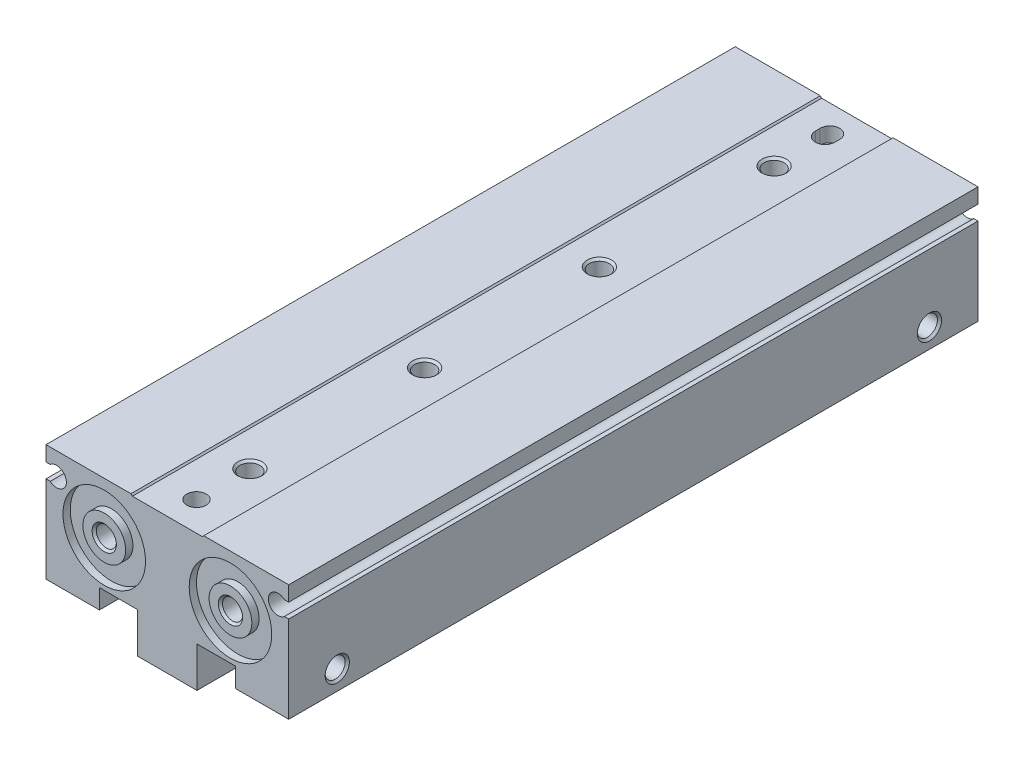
ISO-10303-21;
HEADER;
FILE_DESCRIPTION(('STEP AP214'),'2;1');
FILE_NAME('part.step','',(''),(''),'','','');
FILE_SCHEMA(('AUTOMOTIVE_DESIGN { 1 0 10303 214 1 1 1 1 }'));
ENDSEC;
DATA;
#1=APPLICATION_CONTEXT('core data for automotive mechanical design processes');
#2=APPLICATION_PROTOCOL_DEFINITION('international standard','automotive_design',2000,#1);
#3=PRODUCT_CONTEXT('',#1,'mechanical');
#4=PRODUCT('Part','Part','',(#3));
#5=PRODUCT_RELATED_PRODUCT_CATEGORY('part','',(#4));
#6=PRODUCT_DEFINITION_FORMATION('','',#4);
#7=PRODUCT_DEFINITION_CONTEXT('part definition',#1,'design');
#8=PRODUCT_DEFINITION('design','',#6,#7);
#9=PRODUCT_DEFINITION_SHAPE('','',#8);
#10=(LENGTH_UNIT() NAMED_UNIT(*) SI_UNIT(.MILLI.,.METRE.));
#11=(NAMED_UNIT(*) PLANE_ANGLE_UNIT() SI_UNIT($,.RADIAN.));
#12=(NAMED_UNIT(*) SI_UNIT($,.STERADIAN.) SOLID_ANGLE_UNIT());
#13=UNCERTAINTY_MEASURE_WITH_UNIT(LENGTH_MEASURE(1.E-05),#10,'distance_accuracy_value','');
#14=(GEOMETRIC_REPRESENTATION_CONTEXT(3) GLOBAL_UNCERTAINTY_ASSIGNED_CONTEXT((#13)) GLOBAL_UNIT_ASSIGNED_CONTEXT((#10,
#11,#12)) REPRESENTATION_CONTEXT('',''));
#15=CARTESIAN_POINT('',(0.,0.,0.));
#16=DIRECTION('',(0.,0.,1.));
#17=DIRECTION('',(1.,0.,0.));
#18=AXIS2_PLACEMENT_3D('',#15,#16,#17);
#19=CARTESIAN_POINT('',(6.1,-20.,-20.8));
#20=DIRECTION('',(0.,-1.,0.));
#21=DIRECTION('',(1.,0.,0.));
#22=AXIS2_PLACEMENT_3D('',#19,#20,#21);
#23=PLANE('',#22);
#24=DIRECTION('',(1.,0.,0.));
#25=VECTOR('',#24,1.);
#26=CARTESIAN_POINT('',(6.1,-20.,-20.8));
#27=LINE('',#26,#25);
#28=CARTESIAN_POINT('',(6.1,-20.,-20.8));
#29=VERTEX_POINT('',#28);
#30=CARTESIAN_POINT('',(14.,-20.,-20.8));
#31=VERTEX_POINT('',#30);
#32=EDGE_CURVE('E251',#29,#31,#27,.T.);
#33=ORIENTED_EDGE('',*,*,#32,.T.);
#34=DIRECTION('',(0.,0.,1.));
#35=VECTOR('',#34,1.);
#36=CARTESIAN_POINT('',(14.,-20.,-20.8));
#37=LINE('',#36,#35);
#38=CARTESIAN_POINT('',(14.,-20.,71.));
#39=VERTEX_POINT('',#38);
#40=EDGE_CURVE('E264',#39,#31,#37,.F.);
#41=ORIENTED_EDGE('',*,*,#40,.F.);
#42=DIRECTION('',(-1.,0.,0.));
#43=VECTOR('',#42,1.);
#44=CARTESIAN_POINT('',(14.,-20.,71.));
#45=LINE('',#44,#43);
#46=CARTESIAN_POINT('',(6.1,-20.,71.));
#47=VERTEX_POINT('',#46);
#48=EDGE_CURVE('E272',#47,#39,#45,.F.);
#49=ORIENTED_EDGE('',*,*,#48,.F.);
#50=DIRECTION('',(0.,0.,-1.));
#51=VECTOR('',#50,1.);
#52=CARTESIAN_POINT('',(6.1,-20.,71.));
#53=LINE('',#52,#51);
#54=EDGE_CURVE('E266',#47,#29,#53,.T.);
#55=ORIENTED_EDGE('',*,*,#54,.T.);
#56=EDGE_LOOP('',(#33,#41,#49,#55));
#57=FACE_BOUND('',#56,.T.);
#58=ADVANCED_FACE('F16',(#57),#23,.T.);
#59=CARTESIAN_POINT('',(6.1,-20.,-71.));
#60=DIRECTION('',(0.,-1.,0.));
#61=DIRECTION('',(1.,0.,0.));
#62=AXIS2_PLACEMENT_3D('',#59,#60,#61);
#63=PLANE('',#62);
#64=DIRECTION('',(-1.,0.,0.));
#65=VECTOR('',#64,1.);
#66=CARTESIAN_POINT('',(14.,-20.,-53.8));
#67=LINE('',#66,#65);
#68=CARTESIAN_POINT('',(14.,-20.,-53.8));
#69=VERTEX_POINT('',#68);
#70=CARTESIAN_POINT('',(6.1,-20.,-53.8));
#71=VERTEX_POINT('',#70);
#72=EDGE_CURVE('E283',#69,#71,#67,.T.);
#73=ORIENTED_EDGE('',*,*,#72,.T.);
#74=DIRECTION('',(0.,0.,-1.));
#75=VECTOR('',#74,1.);
#76=CARTESIAN_POINT('',(6.1,-20.,-53.8));
#77=LINE('',#76,#75);
#78=CARTESIAN_POINT('',(6.1,-20.,-71.));
#79=VERTEX_POINT('',#78);
#80=EDGE_CURVE('E288',#71,#79,#77,.T.);
#81=ORIENTED_EDGE('',*,*,#80,.T.);
#82=DIRECTION('',(1.,0.,0.));
#83=VECTOR('',#82,1.);
#84=CARTESIAN_POINT('',(6.1,-20.,-71.));
#85=LINE('',#84,#83);
#86=CARTESIAN_POINT('',(14.,-20.,-71.));
#87=VERTEX_POINT('',#86);
#88=EDGE_CURVE('E293',#79,#87,#85,.T.);
#89=ORIENTED_EDGE('',*,*,#88,.T.);
#90=DIRECTION('',(0.,0.,1.));
#91=VECTOR('',#90,1.);
#92=CARTESIAN_POINT('',(14.,-20.,-71.));
#93=LINE('',#92,#91);
#94=EDGE_CURVE('E298',#69,#87,#93,.F.);
#95=ORIENTED_EDGE('',*,*,#94,.F.);
#96=EDGE_LOOP('',(#73,#81,#89,#95));
#97=FACE_BOUND('',#96,.T.);
#98=ADVANCED_FACE('F990',(#97),#63,.T.);
#99=CARTESIAN_POINT('',(-14.,-20.,53.8));
#100=DIRECTION('',(0.,-1.,0.));
#101=DIRECTION('',(1.,0.,0.));
#102=AXIS2_PLACEMENT_3D('',#99,#100,#101);
#103=PLANE('',#102);
#104=DIRECTION('',(1.,0.,0.));
#105=VECTOR('',#104,1.);
#106=CARTESIAN_POINT('',(-14.,-20.,53.8));
#107=LINE('',#106,#105);
#108=CARTESIAN_POINT('',(-14.,-20.,53.8));
#109=VERTEX_POINT('',#108);
#110=CARTESIAN_POINT('',(-6.1,-20.,53.8));
#111=VERTEX_POINT('',#110);
#112=EDGE_CURVE('E303',#109,#111,#107,.T.);
#113=ORIENTED_EDGE('',*,*,#112,.T.);
#114=DIRECTION('',(0.,0.,1.));
#115=VECTOR('',#114,1.);
#116=CARTESIAN_POINT('',(-6.1,-20.,53.8));
#117=LINE('',#116,#115);
#118=CARTESIAN_POINT('',(-6.1,-20.,71.));
#119=VERTEX_POINT('',#118);
#120=EDGE_CURVE('E308',#119,#111,#117,.F.);
#121=ORIENTED_EDGE('',*,*,#120,.F.);
#122=DIRECTION('',(-1.,0.,0.));
#123=VECTOR('',#122,1.);
#124=CARTESIAN_POINT('',(-6.1,-20.,71.));
#125=LINE('',#124,#123);
#126=CARTESIAN_POINT('',(-14.,-20.,71.));
#127=VERTEX_POINT('',#126);
#128=EDGE_CURVE('E313',#127,#119,#125,.F.);
#129=ORIENTED_EDGE('',*,*,#128,.F.);
#130=DIRECTION('',(0.,0.,-1.));
#131=VECTOR('',#130,1.);
#132=CARTESIAN_POINT('',(-14.,-20.,71.));
#133=LINE('',#132,#131);
#134=EDGE_CURVE('E317',#127,#109,#133,.T.);
#135=ORIENTED_EDGE('',*,*,#134,.T.);
#136=EDGE_LOOP('',(#113,#121,#129,#135));
#137=FACE_BOUND('',#136,.T.);
#138=ADVANCED_FACE('F995',(#137),#103,.T.);
#139=CARTESIAN_POINT('',(-14.,-20.,-71.));
#140=DIRECTION('',(0.,-1.,0.));
#141=DIRECTION('',(1.,0.,0.));
#142=AXIS2_PLACEMENT_3D('',#139,#140,#141);
#143=PLANE('',#142);
#144=DIRECTION('',(-1.,0.,0.));
#145=VECTOR('',#144,1.);
#146=CARTESIAN_POINT('',(-6.1,-20.,20.8));
#147=LINE('',#146,#145);
#148=CARTESIAN_POINT('',(-6.1,-20.,20.8));
#149=VERTEX_POINT('',#148);
#150=CARTESIAN_POINT('',(-14.,-20.,20.8));
#151=VERTEX_POINT('',#150);
#152=EDGE_CURVE('E322',#149,#151,#147,.T.);
#153=ORIENTED_EDGE('',*,*,#152,.T.);
#154=DIRECTION('',(0.,0.,-1.));
#155=VECTOR('',#154,1.);
#156=CARTESIAN_POINT('',(-14.,-20.,20.8));
#157=LINE('',#156,#155);
#158=CARTESIAN_POINT('',(-14.,-20.,-71.));
#159=VERTEX_POINT('',#158);
#160=EDGE_CURVE('E327',#151,#159,#157,.T.);
#161=ORIENTED_EDGE('',*,*,#160,.T.);
#162=DIRECTION('',(1.,0.,0.));
#163=VECTOR('',#162,1.);
#164=CARTESIAN_POINT('',(-14.,-20.,-71.));
#165=LINE('',#164,#163);
#166=CARTESIAN_POINT('',(-6.1,-20.,-71.));
#167=VERTEX_POINT('',#166);
#168=EDGE_CURVE('E332',#159,#167,#165,.T.);
#169=ORIENTED_EDGE('',*,*,#168,.T.);
#170=DIRECTION('',(0.,0.,1.));
#171=VECTOR('',#170,1.);
#172=CARTESIAN_POINT('',(-6.1,-20.,-71.));
#173=LINE('',#172,#171);
#174=EDGE_CURVE('E337',#149,#167,#173,.F.);
#175=ORIENTED_EDGE('',*,*,#174,.F.);
#176=EDGE_LOOP('',(#153,#161,#169,#175));
#177=FACE_BOUND('',#176,.T.);
#178=ADVANCED_FACE('F1001',(#177),#143,.T.);
#179=CARTESIAN_POINT('',(-25.,-6.1,71.));
#180=DIRECTION('',(0.,1.,0.));
#181=DIRECTION('',(1.,0.,0.));
#182=AXIS2_PLACEMENT_3D('',#179,#180,#181);
#183=PLANE('',#182);
#184=DIRECTION('',(-1.,0.,0.));
#185=VECTOR('',#184,1.);
#186=CARTESIAN_POINT('',(-24.122875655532,-6.1,-71.));
#187=LINE('',#186,#185);
#188=CARTESIAN_POINT('',(-24.122875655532,-6.1,-71.));
#189=VERTEX_POINT('',#188);
#190=CARTESIAN_POINT('',(-25.,-6.1,-71.));
#191=VERTEX_POINT('',#190);
#192=EDGE_CURVE('E342',#189,#191,#187,.T.);
#193=ORIENTED_EDGE('',*,*,#192,.T.);
#194=DIRECTION('',(0.,0.,1.));
#195=VECTOR('',#194,1.);
#196=CARTESIAN_POINT('',(-25.,-6.1,-71.));
#197=LINE('',#196,#195);
#198=CARTESIAN_POINT('',(-25.,-6.1,71.));
#199=VERTEX_POINT('',#198);
#200=EDGE_CURVE('E347',#199,#191,#197,.F.);
#201=ORIENTED_EDGE('',*,*,#200,.F.);
#202=DIRECTION('',(1.,0.,0.));
#203=VECTOR('',#202,1.);
#204=CARTESIAN_POINT('',(-25.,-6.1,71.));
#205=LINE('',#204,#203);
#206=CARTESIAN_POINT('',(-24.122875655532,-6.1,71.));
#207=VERTEX_POINT('',#206);
#208=EDGE_CURVE('E352',#207,#199,#205,.F.);
#209=ORIENTED_EDGE('',*,*,#208,.F.);
#210=DIRECTION('',(0.,0.,-1.));
#211=VECTOR('',#210,1.);
#212=CARTESIAN_POINT('',(-24.122875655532,-6.1,71.));
#213=LINE('',#212,#211);
#214=EDGE_CURVE('E356',#207,#189,#213,.T.);
#215=ORIENTED_EDGE('',*,*,#214,.T.);
#216=EDGE_LOOP('',(#193,#201,#209,#215));
#217=FACE_BOUND('',#216,.T.);
#218=ADVANCED_FACE('F1005',(#217),#183,.T.);
#219=CARTESIAN_POINT('',(-25.,-24.,71.));
#220=DIRECTION('',(-1.,0.,0.));
#221=DIRECTION('',(0.,1.,0.));
#222=AXIS2_PLACEMENT_3D('',#219,#220,#221);
#223=PLANE('',#222);
#224=DIRECTION('',(0.,-1.,0.));
#225=VECTOR('',#224,1.);
#226=CARTESIAN_POINT('',(-25.,-6.1,-71.));
#227=LINE('',#226,#225);
#228=CARTESIAN_POINT('',(-25.,-24.,-71.));
#229=VERTEX_POINT('',#228);
#230=EDGE_CURVE('E361',#191,#229,#227,.T.);
#231=ORIENTED_EDGE('',*,*,#230,.T.);
#232=DIRECTION('',(0.,0.,1.));
#233=VECTOR('',#232,1.);
#234=CARTESIAN_POINT('',(-25.,-24.,-71.));
#235=LINE('',#234,#233);
#236=CARTESIAN_POINT('',(-25.,-24.,71.));
#237=VERTEX_POINT('',#236);
#238=EDGE_CURVE('E366',#237,#229,#235,.F.);
#239=ORIENTED_EDGE('',*,*,#238,.F.);
#240=DIRECTION('',(0.,1.,0.));
#241=VECTOR('',#240,1.);
#242=CARTESIAN_POINT('',(-25.,-24.,71.));
#243=LINE('',#242,#241);
#244=EDGE_CURVE('E371',#199,#237,#243,.F.);
#245=ORIENTED_EDGE('',*,*,#244,.F.);
#246=ORIENTED_EDGE('',*,*,#200,.T.);
#247=EDGE_LOOP('',(#231,#239,#245,#246));
#248=FACE_BOUND('',#247,.T.);
#249=CARTESIAN_POINT('',(-25.,-20.,-61.));
#250=DIRECTION('',(1.,0.,0.));
#251=DIRECTION('',(0.,0.,1.));
#252=AXIS2_PLACEMENT_3D('',#249,#250,#251);
#253=CIRCLE('',#252,2.5);
#254=CARTESIAN_POINT('',(-25.,-20.,-58.5));
#255=VERTEX_POINT('',#254);
#256=EDGE_CURVE('E375',#255,#255,#253,.F.);
#257=ORIENTED_EDGE('',*,*,#256,.F.);
#258=EDGE_LOOP('',(#257));
#259=FACE_BOUND('',#258,.T.);
#260=CARTESIAN_POINT('',(-25.,-20.,61.));
#261=DIRECTION('',(1.,0.,0.));
#262=DIRECTION('',(0.,0.,1.));
#263=AXIS2_PLACEMENT_3D('',#260,#261,#262);
#264=CIRCLE('',#263,2.5);
#265=CARTESIAN_POINT('',(-25.,-20.,63.5));
#266=VERTEX_POINT('',#265);
#267=EDGE_CURVE('E380',#266,#266,#264,.F.);
#268=ORIENTED_EDGE('',*,*,#267,.F.);
#269=EDGE_LOOP('',(#268));
#270=FACE_BOUND('',#269,.T.);
#271=ADVANCED_FACE('F1009',(#248,#259,#270),#223,.T.);
#272=CARTESIAN_POINT('',(-25.,-24.,-71.));
#273=DIRECTION('',(0.,-1.,0.));
#274=DIRECTION('',(1.,0.,0.));
#275=AXIS2_PLACEMENT_3D('',#272,#273,#274);
#276=PLANE('',#275);
#277=DIRECTION('',(1.,0.,0.));
#278=VECTOR('',#277,1.);
#279=CARTESIAN_POINT('',(-25.,-24.,-71.));
#280=LINE('',#279,#278);
#281=CARTESIAN_POINT('',(-14.,-24.,-71.));
#282=VERTEX_POINT('',#281);
#283=EDGE_CURVE('E383',#229,#282,#280,.T.);
#284=ORIENTED_EDGE('',*,*,#283,.T.);
#285=DIRECTION('',(0.,0.,1.));
#286=VECTOR('',#285,1.);
#287=CARTESIAN_POINT('',(-14.,-24.,-71.));
#288=LINE('',#287,#286);
#289=CARTESIAN_POINT('',(-14.,-24.,71.));
#290=VERTEX_POINT('',#289);
#291=EDGE_CURVE('E386',#290,#282,#288,.F.);
#292=ORIENTED_EDGE('',*,*,#291,.F.);
#293=DIRECTION('',(-1.,0.,0.));
#294=VECTOR('',#293,1.);
#295=CARTESIAN_POINT('',(-14.,-24.,71.));
#296=LINE('',#295,#294);
#297=EDGE_CURVE('E391',#237,#290,#296,.F.);
#298=ORIENTED_EDGE('',*,*,#297,.F.);
#299=ORIENTED_EDGE('',*,*,#238,.T.);
#300=EDGE_LOOP('',(#284,#292,#298,#299));
#301=FACE_BOUND('',#300,.T.);
#302=CARTESIAN_POINT('',(-21.5,-24.,53.));
#303=DIRECTION('',(0.,1.,0.));
#304=DIRECTION('',(-1.42053781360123E-07,0.,-0.99999999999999));
#305=AXIS2_PLACEMENT_3D('',#302,#303,#304);
#306=CIRCLE('',#305,2.5);
#307=CARTESIAN_POINT('',(-21.5000003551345,-24.,50.5));
#308=VERTEX_POINT('',#307);
#309=EDGE_CURVE('E395',#308,#308,#306,.T.);
#310=ORIENTED_EDGE('',*,*,#309,.T.);
#311=EDGE_LOOP('',(#310));
#312=FACE_BOUND('',#311,.T.);
#313=CARTESIAN_POINT('',(-21.5,-24.,-53.));
#314=DIRECTION('',(0.,1.,0.));
#315=DIRECTION('',(0.,0.,-1.));
#316=AXIS2_PLACEMENT_3D('',#313,#314,#315);
#317=CIRCLE('',#316,2.5);
#318=CARTESIAN_POINT('',(-21.5,-24.,-55.5));
#319=VERTEX_POINT('',#318);
#320=EDGE_CURVE('E400',#319,#319,#317,.T.);
#321=ORIENTED_EDGE('',*,*,#320,.T.);
#322=EDGE_LOOP('',(#321));
#323=FACE_BOUND('',#322,.T.);
#324=ADVANCED_FACE('F1013',(#301,#312,#323),#276,.T.);
#325=CARTESIAN_POINT('',(-14.,-24.,-71.));
#326=DIRECTION('',(1.,0.,0.));
#327=DIRECTION('',(0.,1.,0.));
#328=AXIS2_PLACEMENT_3D('',#325,#326,#327);
#329=PLANE('',#328);
#330=DIRECTION('',(0.,1.,0.));
#331=VECTOR('',#330,1.);
#332=CARTESIAN_POINT('',(-14.,-24.,-71.));
#333=LINE('',#332,#331);
#334=EDGE_CURVE('E403',#282,#159,#333,.T.);
#335=ORIENTED_EDGE('',*,*,#334,.T.);
#336=ORIENTED_EDGE('',*,*,#160,.F.);
#337=DIRECTION('',(0.,1.,0.));
#338=VECTOR('',#337,1.);
#339=CARTESIAN_POINT('',(-14.,-20.,20.8));
#340=LINE('',#339,#338);
#341=CARTESIAN_POINT('',(-14.,-18.4,20.8));
#342=VERTEX_POINT('',#341);
#343=EDGE_CURVE('E406',#342,#151,#340,.F.);
#344=ORIENTED_EDGE('',*,*,#343,.F.);
#345=DIRECTION('',(0.,0.,1.));
#346=VECTOR('',#345,1.);
#347=CARTESIAN_POINT('',(-14.,-18.4,20.8));
#348=LINE('',#347,#346);
#349=CARTESIAN_POINT('',(-14.,-18.4,53.8));
#350=VERTEX_POINT('',#349);
#351=EDGE_CURVE('E410',#342,#350,#348,.T.);
#352=ORIENTED_EDGE('',*,*,#351,.T.);
#353=DIRECTION('',(0.,-1.,0.));
#354=VECTOR('',#353,1.);
#355=CARTESIAN_POINT('',(-14.,-18.4,53.8));
#356=LINE('',#355,#354);
#357=EDGE_CURVE('E415',#350,#109,#356,.T.);
#358=ORIENTED_EDGE('',*,*,#357,.T.);
#359=ORIENTED_EDGE('',*,*,#134,.F.);
#360=DIRECTION('',(0.,-1.,0.));
#361=VECTOR('',#360,1.);
#362=CARTESIAN_POINT('',(-14.,-20.,71.));
#363=LINE('',#362,#361);
#364=EDGE_CURVE('E420',#290,#127,#363,.F.);
#365=ORIENTED_EDGE('',*,*,#364,.F.);
#366=ORIENTED_EDGE('',*,*,#291,.T.);
#367=EDGE_LOOP('',(#335,#336,#344,#352,#358,#359,#365,#366));
#368=FACE_BOUND('',#367,.T.);
#369=ADVANCED_FACE('F1017',(#368),#329,.T.);
#370=CARTESIAN_POINT('',(-6.1,-28.3,71.));
#371=DIRECTION('',(-1.,0.,0.));
#372=DIRECTION('',(0.,1.,0.));
#373=AXIS2_PLACEMENT_3D('',#370,#371,#372);
#374=PLANE('',#373);
#375=DIRECTION('',(0.,-1.,0.));
#376=VECTOR('',#375,1.);
#377=CARTESIAN_POINT('',(-6.1,-20.,-71.));
#378=LINE('',#377,#376);
#379=CARTESIAN_POINT('',(-6.1,-28.3,-71.));
#380=VERTEX_POINT('',#379);
#381=EDGE_CURVE('E424',#167,#380,#378,.T.);
#382=ORIENTED_EDGE('',*,*,#381,.T.);
#383=DIRECTION('',(0.,0.,1.));
#384=VECTOR('',#383,1.);
#385=CARTESIAN_POINT('',(-6.1,-28.3,-71.));
#386=LINE('',#385,#384);
#387=CARTESIAN_POINT('',(-6.1,-28.3,71.));
#388=VERTEX_POINT('',#387);
#389=EDGE_CURVE('E429',#388,#380,#386,.F.);
#390=ORIENTED_EDGE('',*,*,#389,.F.);
#391=DIRECTION('',(0.,1.,0.));
#392=VECTOR('',#391,1.);
#393=CARTESIAN_POINT('',(-6.1,-28.3,71.));
#394=LINE('',#393,#392);
#395=EDGE_CURVE('E434',#119,#388,#394,.F.);
#396=ORIENTED_EDGE('',*,*,#395,.F.);
#397=ORIENTED_EDGE('',*,*,#120,.T.);
#398=DIRECTION('',(0.,1.,0.));
#399=VECTOR('',#398,1.);
#400=CARTESIAN_POINT('',(-6.1,-20.,53.8));
#401=LINE('',#400,#399);
#402=CARTESIAN_POINT('',(-6.1,-18.4,53.8));
#403=VERTEX_POINT('',#402);
#404=EDGE_CURVE('E438',#403,#111,#401,.F.);
#405=ORIENTED_EDGE('',*,*,#404,.F.);
#406=DIRECTION('',(0.,0.,-1.));
#407=VECTOR('',#406,1.);
#408=CARTESIAN_POINT('',(-6.1,-18.4,53.8));
#409=LINE('',#408,#407);
#410=CARTESIAN_POINT('',(-6.1,-18.4,20.8));
#411=VERTEX_POINT('',#410);
#412=EDGE_CURVE('E442',#403,#411,#409,.T.);
#413=ORIENTED_EDGE('',*,*,#412,.T.);
#414=DIRECTION('',(0.,-1.,0.));
#415=VECTOR('',#414,1.);
#416=CARTESIAN_POINT('',(-6.1,-18.4,20.8));
#417=LINE('',#416,#415);
#418=EDGE_CURVE('E447',#411,#149,#417,.T.);
#419=ORIENTED_EDGE('',*,*,#418,.T.);
#420=ORIENTED_EDGE('',*,*,#174,.T.);
#421=EDGE_LOOP('',(#382,#390,#396,#397,#405,#413,#419,#420));
#422=FACE_BOUND('',#421,.T.);
#423=ADVANCED_FACE('F1021',(#422),#374,.T.);
#424=CARTESIAN_POINT('',(-6.1,-28.3,-71.));
#425=DIRECTION('',(0.,-1.,0.));
#426=DIRECTION('',(1.,0.,0.));
#427=AXIS2_PLACEMENT_3D('',#424,#425,#426);
#428=PLANE('',#427);
#429=DIRECTION('',(1.,0.,0.));
#430=VECTOR('',#429,1.);
#431=CARTESIAN_POINT('',(-6.1,-28.3,-71.));
#432=LINE('',#431,#430);
#433=CARTESIAN_POINT('',(6.1,-28.3,-71.));
#434=VERTEX_POINT('',#433);
#435=EDGE_CURVE('E452',#380,#434,#432,.T.);
#436=ORIENTED_EDGE('',*,*,#435,.T.);
#437=DIRECTION('',(0.,0.,1.));
#438=VECTOR('',#437,1.);
#439=CARTESIAN_POINT('',(6.1,-28.3,-71.));
#440=LINE('',#439,#438);
#441=CARTESIAN_POINT('',(6.1,-28.3,71.));
#442=VERTEX_POINT('',#441);
#443=EDGE_CURVE('E457',#442,#434,#440,.F.);
#444=ORIENTED_EDGE('',*,*,#443,.F.);
#445=DIRECTION('',(-1.,0.,0.));
#446=VECTOR('',#445,1.);
#447=CARTESIAN_POINT('',(6.1,-28.3,71.));
#448=LINE('',#447,#446);
#449=EDGE_CURVE('E462',#388,#442,#448,.F.);
#450=ORIENTED_EDGE('',*,*,#449,.F.);
#451=ORIENTED_EDGE('',*,*,#389,.T.);
#452=EDGE_LOOP('',(#436,#444,#450,#451));
#453=FACE_BOUND('',#452,.T.);
#454=CARTESIAN_POINT('',(0.,-28.3,18.));
#455=DIRECTION('',(0.,1.,0.));
#456=DIRECTION('',(0.,0.,-1.));
#457=AXIS2_PLACEMENT_3D('',#454,#455,#456);
#458=CIRCLE('',#457,3.75);
#459=CARTESIAN_POINT('',(0.,-28.3,14.25));
#460=VERTEX_POINT('',#459);
#461=EDGE_CURVE('E466',#460,#460,#458,.F.);
#462=ORIENTED_EDGE('',*,*,#461,.F.);
#463=EDGE_LOOP('',(#462));
#464=FACE_BOUND('',#463,.T.);
#465=CARTESIAN_POINT('',(0.,-28.3,54.));
#466=DIRECTION('',(0.,1.,0.));
#467=DIRECTION('',(0.,0.,-1.));
#468=AXIS2_PLACEMENT_3D('',#465,#466,#467);
#469=CIRCLE('',#468,3.75);
#470=CARTESIAN_POINT('',(0.,-28.3,50.25));
#471=VERTEX_POINT('',#470);
#472=EDGE_CURVE('E471',#471,#471,#469,.F.);
#473=ORIENTED_EDGE('',*,*,#472,.F.);
#474=EDGE_LOOP('',(#473));
#475=FACE_BOUND('',#474,.T.);
#476=CARTESIAN_POINT('',(0.,-28.3,-54.));
#477=DIRECTION('',(0.,1.,0.));
#478=DIRECTION('',(0.,0.,-1.));
#479=AXIS2_PLACEMENT_3D('',#476,#477,#478);
#480=CIRCLE('',#479,3.75);
#481=CARTESIAN_POINT('',(0.,-28.3,-57.75));
#482=VERTEX_POINT('',#481);
#483=EDGE_CURVE('E474',#482,#482,#480,.F.);
#484=ORIENTED_EDGE('',*,*,#483,.F.);
#485=EDGE_LOOP('',(#484));
#486=FACE_BOUND('',#485,.T.);
#487=CARTESIAN_POINT('',(0.,-28.3,-18.));
#488=DIRECTION('',(0.,1.,0.));
#489=DIRECTION('',(0.,0.,-1.));
#490=AXIS2_PLACEMENT_3D('',#487,#488,#489);
#491=CIRCLE('',#490,3.75);
#492=CARTESIAN_POINT('',(0.,-28.3,-21.75));
#493=VERTEX_POINT('',#492);
#494=EDGE_CURVE('E477',#493,#493,#491,.F.);
#495=ORIENTED_EDGE('',*,*,#494,.F.);
#496=EDGE_LOOP('',(#495));
#497=FACE_BOUND('',#496,.T.);
#498=ADVANCED_FACE('F1025',(#453,#464,#475,#486,#497),#428,.T.);
#499=CARTESIAN_POINT('',(6.1,-28.3,-71.));
#500=DIRECTION('',(1.,0.,0.));
#501=DIRECTION('',(0.,1.,0.));
#502=AXIS2_PLACEMENT_3D('',#499,#500,#501);
#503=PLANE('',#502);
#504=DIRECTION('',(0.,1.,0.));
#505=VECTOR('',#504,1.);
#506=CARTESIAN_POINT('',(6.1,-28.3,-71.));
#507=LINE('',#506,#505);
#508=EDGE_CURVE('E480',#434,#79,#507,.T.);
#509=ORIENTED_EDGE('',*,*,#508,.T.);
#510=ORIENTED_EDGE('',*,*,#80,.F.);
#511=DIRECTION('',(0.,1.,0.));
#512=VECTOR('',#511,1.);
#513=CARTESIAN_POINT('',(6.1,-20.,-53.8));
#514=LINE('',#513,#512);
#515=CARTESIAN_POINT('',(6.1,-18.4,-53.8));
#516=VERTEX_POINT('',#515);
#517=EDGE_CURVE('E483',#516,#71,#514,.F.);
#518=ORIENTED_EDGE('',*,*,#517,.F.);
#519=DIRECTION('',(0.,0.,1.));
#520=VECTOR('',#519,1.);
#521=CARTESIAN_POINT('',(6.1,-18.4,-53.8));
#522=LINE('',#521,#520);
#523=CARTESIAN_POINT('',(6.1,-18.4,-20.8));
#524=VERTEX_POINT('',#523);
#525=EDGE_CURVE('E487',#516,#524,#522,.T.);
#526=ORIENTED_EDGE('',*,*,#525,.T.);
#527=DIRECTION('',(0.,-1.,0.));
#528=VECTOR('',#527,1.);
#529=CARTESIAN_POINT('',(6.1,-18.4,-20.8));
#530=LINE('',#529,#528);
#531=EDGE_CURVE('E492',#524,#29,#530,.T.);
#532=ORIENTED_EDGE('',*,*,#531,.T.);
#533=ORIENTED_EDGE('',*,*,#54,.F.);
#534=DIRECTION('',(0.,-1.,0.));
#535=VECTOR('',#534,1.);
#536=CARTESIAN_POINT('',(6.1,-20.,71.));
#537=LINE('',#536,#535);
#538=EDGE_CURVE('E496',#442,#47,#537,.F.);
#539=ORIENTED_EDGE('',*,*,#538,.F.);
#540=ORIENTED_EDGE('',*,*,#443,.T.);
#541=EDGE_LOOP('',(#509,#510,#518,#526,#532,#533,#539,#540));
#542=FACE_BOUND('',#541,.T.);
#543=ADVANCED_FACE('F1029',(#542),#503,.T.);
#544=CARTESIAN_POINT('',(14.,-24.,71.));
#545=DIRECTION('',(-1.,0.,0.));
#546=DIRECTION('',(0.,1.,0.));
#547=AXIS2_PLACEMENT_3D('',#544,#545,#546);
#548=PLANE('',#547);
#549=DIRECTION('',(0.,-1.,0.));
#550=VECTOR('',#549,1.);
#551=CARTESIAN_POINT('',(14.,-20.,-71.));
#552=LINE('',#551,#550);
#553=CARTESIAN_POINT('',(14.,-24.,-71.));
#554=VERTEX_POINT('',#553);
#555=EDGE_CURVE('E500',#87,#554,#552,.T.);
#556=ORIENTED_EDGE('',*,*,#555,.T.);
#557=DIRECTION('',(0.,0.,1.));
#558=VECTOR('',#557,1.);
#559=CARTESIAN_POINT('',(14.,-24.,-71.));
#560=LINE('',#559,#558);
#561=CARTESIAN_POINT('',(14.,-24.,71.));
#562=VERTEX_POINT('',#561);
#563=EDGE_CURVE('E504',#562,#554,#560,.F.);
#564=ORIENTED_EDGE('',*,*,#563,.F.);
#565=DIRECTION('',(0.,1.,0.));
#566=VECTOR('',#565,1.);
#567=CARTESIAN_POINT('',(14.,-24.,71.));
#568=LINE('',#567,#566);
#569=EDGE_CURVE('E258',#39,#562,#568,.F.);
#570=ORIENTED_EDGE('',*,*,#569,.F.);
#571=ORIENTED_EDGE('',*,*,#40,.T.);
#572=DIRECTION('',(0.,1.,0.));
#573=VECTOR('',#572,1.);
#574=CARTESIAN_POINT('',(14.,-20.,-20.8));
#575=LINE('',#574,#573);
#576=CARTESIAN_POINT('',(14.,-18.4,-20.8));
#577=VERTEX_POINT('',#576);
#578=EDGE_CURVE('E247',#577,#31,#575,.F.);
#579=ORIENTED_EDGE('',*,*,#578,.F.);
#580=DIRECTION('',(0.,0.,-1.));
#581=VECTOR('',#580,1.);
#582=CARTESIAN_POINT('',(14.,-18.4,-20.8));
#583=LINE('',#582,#581);
#584=CARTESIAN_POINT('',(14.,-18.4,-53.8));
#585=VERTEX_POINT('',#584);
#586=EDGE_CURVE('E257',#577,#585,#583,.T.);
#587=ORIENTED_EDGE('',*,*,#586,.T.);
#588=DIRECTION('',(0.,-1.,0.));
#589=VECTOR('',#588,1.);
#590=CARTESIAN_POINT('',(14.,-18.4,-53.8));
#591=LINE('',#590,#589);
#592=EDGE_CURVE('E517',#585,#69,#591,.T.);
#593=ORIENTED_EDGE('',*,*,#592,.T.);
#594=ORIENTED_EDGE('',*,*,#94,.T.);
#595=EDGE_LOOP('',(#556,#564,#570,#571,#579,#587,#593,#594));
#596=FACE_BOUND('',#595,.T.);
#597=ADVANCED_FACE('F270',(#596),#548,.T.);
#598=CARTESIAN_POINT('',(14.,-24.,-71.));
#599=DIRECTION('',(0.,-1.,0.));
#600=DIRECTION('',(1.,0.,0.));
#601=AXIS2_PLACEMENT_3D('',#598,#599,#600);
#602=PLANE('',#601);
#603=DIRECTION('',(1.,0.,0.));
#604=VECTOR('',#603,1.);
#605=CARTESIAN_POINT('',(14.,-24.,-71.));
#606=LINE('',#605,#604);
#607=CARTESIAN_POINT('',(25.,-24.,-71.));
#608=VERTEX_POINT('',#607);
#609=EDGE_CURVE('E522',#554,#608,#606,.T.);
#610=ORIENTED_EDGE('',*,*,#609,.T.);
#611=DIRECTION('',(0.,0.,1.));
#612=VECTOR('',#611,1.);
#613=CARTESIAN_POINT('',(25.,-24.,-71.));
#614=LINE('',#613,#612);
#615=CARTESIAN_POINT('',(25.,-24.,71.));
#616=VERTEX_POINT('',#615);
#617=EDGE_CURVE('E527',#616,#608,#614,.F.);
#618=ORIENTED_EDGE('',*,*,#617,.F.);
#619=DIRECTION('',(-1.,0.,0.));
#620=VECTOR('',#619,1.);
#621=CARTESIAN_POINT('',(25.,-24.,71.));
#622=LINE('',#621,#620);
#623=EDGE_CURVE('E532',#562,#616,#622,.F.);
#624=ORIENTED_EDGE('',*,*,#623,.F.);
#625=ORIENTED_EDGE('',*,*,#563,.T.);
#626=EDGE_LOOP('',(#610,#618,#624,#625));
#627=FACE_BOUND('',#626,.T.);
#628=CARTESIAN_POINT('',(21.5,-24.,-53.));
#629=DIRECTION('',(0.,1.,0.));
#630=DIRECTION('',(0.,0.,-1.));
#631=AXIS2_PLACEMENT_3D('',#628,#629,#630);
#632=CIRCLE('',#631,2.5);
#633=CARTESIAN_POINT('',(21.5,-24.,-55.5));
#634=VERTEX_POINT('',#633);
#635=EDGE_CURVE('E536',#634,#634,#632,.T.);
#636=ORIENTED_EDGE('',*,*,#635,.T.);
#637=EDGE_LOOP('',(#636));
#638=FACE_BOUND('',#637,.T.);
#639=CARTESIAN_POINT('',(21.5,-24.,53.));
#640=DIRECTION('',(0.,1.,0.));
#641=DIRECTION('',(-1.42054091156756E-07,0.,-0.99999999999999));
#642=AXIS2_PLACEMENT_3D('',#639,#640,#641);
#643=CIRCLE('',#642,2.5);
#644=CARTESIAN_POINT('',(21.4999996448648,-24.,50.5));
#645=VERTEX_POINT('',#644);
#646=EDGE_CURVE('E541',#645,#645,#643,.T.);
#647=ORIENTED_EDGE('',*,*,#646,.T.);
#648=EDGE_LOOP('',(#647));
#649=FACE_BOUND('',#648,.T.);
#650=ADVANCED_FACE('F1036',(#627,#638,#649),#602,.T.);
#651=CARTESIAN_POINT('',(25.,-24.,-71.));
#652=DIRECTION('',(1.,0.,0.));
#653=DIRECTION('',(0.,1.,0.));
#654=AXIS2_PLACEMENT_3D('',#651,#652,#653);
#655=PLANE('',#654);
#656=DIRECTION('',(0.,1.,0.));
#657=VECTOR('',#656,1.);
#658=CARTESIAN_POINT('',(25.,-24.,-71.));
#659=LINE('',#658,#657);
#660=CARTESIAN_POINT('',(25.,-6.1,-71.));
#661=VERTEX_POINT('',#660);
#662=EDGE_CURVE('E544',#608,#661,#659,.T.);
#663=ORIENTED_EDGE('',*,*,#662,.T.);
#664=DIRECTION('',(0.,0.,1.));
#665=VECTOR('',#664,1.);
#666=CARTESIAN_POINT('',(25.,-6.1,-71.));
#667=LINE('',#666,#665);
#668=CARTESIAN_POINT('',(25.,-6.1,71.));
#669=VERTEX_POINT('',#668);
#670=EDGE_CURVE('E547',#669,#661,#667,.F.);
#671=ORIENTED_EDGE('',*,*,#670,.F.);
#672=DIRECTION('',(0.,-1.,0.));
#673=VECTOR('',#672,1.);
#674=CARTESIAN_POINT('',(25.,-6.1,71.));
#675=LINE('',#674,#673);
#676=EDGE_CURVE('E552',#616,#669,#675,.F.);
#677=ORIENTED_EDGE('',*,*,#676,.F.);
#678=ORIENTED_EDGE('',*,*,#617,.T.);
#679=EDGE_LOOP('',(#663,#671,#677,#678));
#680=FACE_BOUND('',#679,.T.);
#681=CARTESIAN_POINT('',(25.,-20.,-61.));
#682=DIRECTION('',(-1.,0.,0.));
#683=DIRECTION('',(0.,0.,-1.));
#684=AXIS2_PLACEMENT_3D('',#681,#682,#683);
#685=CIRCLE('',#684,2.5);
#686=CARTESIAN_POINT('',(25.,-20.,-63.5));
#687=VERTEX_POINT('',#686);
#688=EDGE_CURVE('E556',#687,#687,#685,.T.);
#689=ORIENTED_EDGE('',*,*,#688,.T.);
#690=EDGE_LOOP('',(#689));
#691=FACE_BOUND('',#690,.T.);
#692=CARTESIAN_POINT('',(25.,-20.,61.));
#693=DIRECTION('',(-1.,0.,0.));
#694=DIRECTION('',(0.,-1.42053781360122E-07,-0.99999999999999));
#695=AXIS2_PLACEMENT_3D('',#692,#693,#694);
#696=CIRCLE('',#695,2.5);
#697=CARTESIAN_POINT('',(25.,-20.0000003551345,58.5));
#698=VERTEX_POINT('',#697);
#699=EDGE_CURVE('E561',#698,#698,#696,.T.);
#700=ORIENTED_EDGE('',*,*,#699,.T.);
#701=EDGE_LOOP('',(#700));
#702=FACE_BOUND('',#701,.T.);
#703=ADVANCED_FACE('F1039',(#680,#691,#702),#655,.T.);
#704=CARTESIAN_POINT('',(24.122875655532,-6.1,71.));
#705=DIRECTION('',(0.,1.,0.));
#706=DIRECTION('',(1.,0.,0.));
#707=AXIS2_PLACEMENT_3D('',#704,#705,#706);
#708=PLANE('',#707);
#709=DIRECTION('',(-1.,0.,0.));
#710=VECTOR('',#709,1.);
#711=CARTESIAN_POINT('',(25.,-6.1,-71.));
#712=LINE('',#711,#710);
#713=CARTESIAN_POINT('',(24.122875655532,-6.1,-71.));
#714=VERTEX_POINT('',#713);
#715=EDGE_CURVE('E564',#661,#714,#712,.T.);
#716=ORIENTED_EDGE('',*,*,#715,.T.);
#717=DIRECTION('',(0.,0.,1.));
#718=VECTOR('',#717,1.);
#719=CARTESIAN_POINT('',(24.122875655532,-6.1,-71.));
#720=LINE('',#719,#718);
#721=CARTESIAN_POINT('',(24.122875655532,-6.1,71.));
#722=VERTEX_POINT('',#721);
#723=EDGE_CURVE('E567',#722,#714,#720,.F.);
#724=ORIENTED_EDGE('',*,*,#723,.F.);
#725=DIRECTION('',(1.,0.,0.));
#726=VECTOR('',#725,1.);
#727=CARTESIAN_POINT('',(24.122875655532,-6.1,71.));
#728=LINE('',#727,#726);
#729=EDGE_CURVE('E572',#669,#722,#728,.F.);
#730=ORIENTED_EDGE('',*,*,#729,.F.);
#731=ORIENTED_EDGE('',*,*,#670,.T.);
#732=EDGE_LOOP('',(#716,#724,#730,#731));
#733=FACE_BOUND('',#732,.T.);
#734=ADVANCED_FACE('F1043',(#733),#708,.T.);
#735=CARTESIAN_POINT('',(22.8,-4.6,71.));
#736=DIRECTION('',(0.,0.,-1.));
#737=DIRECTION('',(0.661437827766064,-0.750000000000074,0.));
#738=AXIS2_PLACEMENT_3D('',#735,#736,#737);
#739=CYLINDRICAL_SURFACE('',#738,1.99999999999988);
#740=ORIENTED_EDGE('',*,*,#723,.T.);
#741=CARTESIAN_POINT('',(22.8,-4.6,-71.));
#742=DIRECTION('',(0.,0.,-1.));
#743=DIRECTION('',(0.661437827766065,-0.750000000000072,0.));
#744=AXIS2_PLACEMENT_3D('',#741,#742,#743);
#745=CIRCLE('',#744,1.99999999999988);
#746=CARTESIAN_POINT('',(24.122875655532,-3.09999999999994,-71.));
#747=VERTEX_POINT('',#746);
#748=EDGE_CURVE('E576',#747,#714,#745,.F.);
#749=ORIENTED_EDGE('',*,*,#748,.F.);
#750=DIRECTION('',(0.,0.,1.));
#751=VECTOR('',#750,1.);
#752=CARTESIAN_POINT('',(24.122875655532,-3.09999999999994,-71.));
#753=LINE('',#752,#751);
#754=CARTESIAN_POINT('',(24.1228756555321,-3.09999999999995,71.));
#755=VERTEX_POINT('',#754);
#756=EDGE_CURVE('E580',#755,#747,#753,.F.);
#757=ORIENTED_EDGE('',*,*,#756,.F.);
#758=CARTESIAN_POINT('',(22.8,-4.6,71.));
#759=DIRECTION('',(0.,0.,1.));
#760=DIRECTION('',(0.661437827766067,0.750000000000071,0.));
#761=AXIS2_PLACEMENT_3D('',#758,#759,#760);
#762=CIRCLE('',#761,1.99999999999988);
#763=EDGE_CURVE('E585',#755,#722,#762,.T.);
#764=ORIENTED_EDGE('',*,*,#763,.T.);
#765=EDGE_LOOP('',(#740,#749,#757,#764));
#766=FACE_BOUND('',#765,.T.);
#767=ADVANCED_FACE('F1047',(#766),#739,.F.);
#768=CARTESIAN_POINT('',(24.122875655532,-3.1,-71.));
#769=DIRECTION('',(0.,-1.,0.));
#770=DIRECTION('',(1.,0.,0.));
#771=AXIS2_PLACEMENT_3D('',#768,#769,#770);
#772=PLANE('',#771);
#773=DIRECTION('',(1.,0.,0.));
#774=VECTOR('',#773,1.);
#775=CARTESIAN_POINT('',(24.122875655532,-3.1,-71.));
#776=LINE('',#775,#774);
#777=CARTESIAN_POINT('',(25.,-3.1,-71.));
#778=VERTEX_POINT('',#777);
#779=EDGE_CURVE('E590',#747,#778,#776,.T.);
#780=ORIENTED_EDGE('',*,*,#779,.T.);
#781=DIRECTION('',(0.,0.,1.));
#782=VECTOR('',#781,1.);
#783=CARTESIAN_POINT('',(25.,-3.1,-71.));
#784=LINE('',#783,#782);
#785=CARTESIAN_POINT('',(25.,-3.1,71.));
#786=VERTEX_POINT('',#785);
#787=EDGE_CURVE('E595',#786,#778,#784,.F.);
#788=ORIENTED_EDGE('',*,*,#787,.F.);
#789=DIRECTION('',(-1.,0.,0.));
#790=VECTOR('',#789,1.);
#791=CARTESIAN_POINT('',(25.,-3.1,71.));
#792=LINE('',#791,#790);
#793=EDGE_CURVE('E600',#755,#786,#792,.F.);
#794=ORIENTED_EDGE('',*,*,#793,.F.);
#795=ORIENTED_EDGE('',*,*,#756,.T.);
#796=EDGE_LOOP('',(#780,#788,#794,#795));
#797=FACE_BOUND('',#796,.T.);
#798=ADVANCED_FACE('F1051',(#797),#772,.T.);
#799=CARTESIAN_POINT('',(25.,-3.1,-71.));
#800=DIRECTION('',(1.,0.,0.));
#801=DIRECTION('',(0.,1.,0.));
#802=AXIS2_PLACEMENT_3D('',#799,#800,#801);
#803=PLANE('',#802);
#804=DIRECTION('',(0.,1.,0.));
#805=VECTOR('',#804,1.);
#806=CARTESIAN_POINT('',(25.,-3.1,-71.));
#807=LINE('',#806,#805);
#808=CARTESIAN_POINT('',(25.,0.,-71.));
#809=VERTEX_POINT('',#808);
#810=EDGE_CURVE('E604',#778,#809,#807,.T.);
#811=ORIENTED_EDGE('',*,*,#810,.T.);
#812=DIRECTION('',(0.,0.,1.));
#813=VECTOR('',#812,1.);
#814=CARTESIAN_POINT('',(25.,0.,-71.));
#815=LINE('',#814,#813);
#816=CARTESIAN_POINT('',(25.,0.,71.));
#817=VERTEX_POINT('',#816);
#818=EDGE_CURVE('E609',#817,#809,#815,.F.);
#819=ORIENTED_EDGE('',*,*,#818,.F.);
#820=DIRECTION('',(0.,-1.,0.));
#821=VECTOR('',#820,1.);
#822=CARTESIAN_POINT('',(25.,0.,71.));
#823=LINE('',#822,#821);
#824=EDGE_CURVE('E614',#786,#817,#823,.F.);
#825=ORIENTED_EDGE('',*,*,#824,.F.);
#826=ORIENTED_EDGE('',*,*,#787,.T.);
#827=EDGE_LOOP('',(#811,#819,#825,#826));
#828=FACE_BOUND('',#827,.T.);
#829=ADVANCED_FACE('F1055',(#828),#803,.T.);
#830=CARTESIAN_POINT('',(7.5,0.,71.));
#831=DIRECTION('',(0.,1.,0.));
#832=DIRECTION('',(1.,0.,0.));
#833=AXIS2_PLACEMENT_3D('',#830,#831,#832);
#834=PLANE('',#833);
#835=DIRECTION('',(-1.,0.,0.));
#836=VECTOR('',#835,1.);
#837=CARTESIAN_POINT('',(25.,0.,-71.));
#838=LINE('',#837,#836);
#839=CARTESIAN_POINT('',(7.5,0.,-71.));
#840=VERTEX_POINT('',#839);
#841=EDGE_CURVE('E618',#809,#840,#838,.T.);
#842=ORIENTED_EDGE('',*,*,#841,.T.);
#843=DIRECTION('',(0.,0.,1.));
#844=VECTOR('',#843,1.);
#845=CARTESIAN_POINT('',(7.5,0.,-71.));
#846=LINE('',#845,#844);
#847=CARTESIAN_POINT('',(7.5,0.,71.));
#848=VERTEX_POINT('',#847);
#849=EDGE_CURVE('E623',#848,#840,#846,.F.);
#850=ORIENTED_EDGE('',*,*,#849,.F.);
#851=DIRECTION('',(1.,0.,0.));
#852=VECTOR('',#851,1.);
#853=CARTESIAN_POINT('',(7.5,0.,71.));
#854=LINE('',#853,#852);
#855=EDGE_CURVE('E628',#817,#848,#854,.F.);
#856=ORIENTED_EDGE('',*,*,#855,.F.);
#857=ORIENTED_EDGE('',*,*,#818,.T.);
#858=EDGE_LOOP('',(#842,#850,#856,#857));
#859=FACE_BOUND('',#858,.T.);
#860=ADVANCED_FACE('F1059',(#859),#834,.T.);
#861=CARTESIAN_POINT('',(7.2,-0.300000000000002,-71.));
#862=DIRECTION('',(-0.707106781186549,0.707106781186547,0.));
#863=DIRECTION('',(0.,0.,1.));
#864=AXIS2_PLACEMENT_3D('',#861,#862,#863);
#865=PLANE('',#864);
#866=DIRECTION('',(-0.707106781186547,-0.707106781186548,0.));
#867=VECTOR('',#866,1.);
#868=CARTESIAN_POINT('',(7.5,0.,-71.));
#869=LINE('',#868,#867);
#870=CARTESIAN_POINT('',(7.2,-0.300000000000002,-71.));
#871=VERTEX_POINT('',#870);
#872=EDGE_CURVE('E632',#840,#871,#869,.T.);
#873=ORIENTED_EDGE('',*,*,#872,.T.);
#874=DIRECTION('',(0.,0.,1.));
#875=VECTOR('',#874,1.);
#876=CARTESIAN_POINT('',(7.2,-0.300000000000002,-71.));
#877=LINE('',#876,#875);
#878=CARTESIAN_POINT('',(7.2,-0.300000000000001,71.));
#879=VERTEX_POINT('',#878);
#880=EDGE_CURVE('E637',#879,#871,#877,.F.);
#881=ORIENTED_EDGE('',*,*,#880,.F.);
#882=DIRECTION('',(0.707106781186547,0.707106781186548,0.));
#883=VECTOR('',#882,1.);
#884=CARTESIAN_POINT('',(7.2,-0.300000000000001,71.));
#885=LINE('',#884,#883);
#886=EDGE_CURVE('E642',#848,#879,#885,.F.);
#887=ORIENTED_EDGE('',*,*,#886,.F.);
#888=ORIENTED_EDGE('',*,*,#849,.T.);
#889=EDGE_LOOP('',(#873,#881,#887,#888));
#890=FACE_BOUND('',#889,.T.);
#891=ADVANCED_FACE('F1063',(#890),#865,.T.);
#892=CARTESIAN_POINT('',(-7.2,-0.3,71.));
#893=DIRECTION('',(0.,1.,0.));
#894=DIRECTION('',(1.,0.,0.));
#895=AXIS2_PLACEMENT_3D('',#892,#893,#894);
#896=PLANE('',#895);
#897=DIRECTION('',(-1.,0.,0.));
#898=VECTOR('',#897,1.);
#899=CARTESIAN_POINT('',(7.2,-0.3,-71.));
#900=LINE('',#899,#898);
#901=CARTESIAN_POINT('',(-7.2,-0.3,-71.));
#902=VERTEX_POINT('',#901);
#903=EDGE_CURVE('E646',#871,#902,#900,.T.);
#904=ORIENTED_EDGE('',*,*,#903,.T.);
#905=DIRECTION('',(0.,0.,1.));
#906=VECTOR('',#905,1.);
#907=CARTESIAN_POINT('',(-7.2,-0.3,-71.));
#908=LINE('',#907,#906);
#909=CARTESIAN_POINT('',(-7.2,-0.3,71.));
#910=VERTEX_POINT('',#909);
#911=EDGE_CURVE('E651',#910,#902,#908,.F.);
#912=ORIENTED_EDGE('',*,*,#911,.F.);
#913=DIRECTION('',(1.,0.,0.));
#914=VECTOR('',#913,1.);
#915=CARTESIAN_POINT('',(-7.2,-0.3,71.));
#916=LINE('',#915,#914);
#917=EDGE_CURVE('E656',#879,#910,#916,.F.);
#918=ORIENTED_EDGE('',*,*,#917,.F.);
#919=ORIENTED_EDGE('',*,*,#880,.T.);
#920=EDGE_LOOP('',(#904,#912,#918,#919));
#921=FACE_BOUND('',#920,.T.);
#922=CARTESIAN_POINT('',(0.,-0.3,18.));
#923=DIRECTION('',(0.,-1.,0.));
#924=DIRECTION('',(-1.42053938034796E-07,0.,0.99999999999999));
#925=AXIS2_PLACEMENT_3D('',#922,#923,#924);
#926=CIRCLE('',#925,2.5);
#927=CARTESIAN_POINT('',(-3.55134845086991E-07,-0.3,20.5));
#928=VERTEX_POINT('',#927);
#929=EDGE_CURVE('E660',#928,#928,#926,.T.);
#930=ORIENTED_EDGE('',*,*,#929,.T.);
#931=EDGE_LOOP('',(#930));
#932=FACE_BOUND('',#931,.T.);
#933=CARTESIAN_POINT('',(0.,-0.3,54.));
#934=DIRECTION('',(0.,-1.,0.));
#935=DIRECTION('',(-1.42053782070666E-07,0.,0.99999999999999));
#936=AXIS2_PLACEMENT_3D('',#933,#934,#935);
#937=CIRCLE('',#936,2.5);
#938=CARTESIAN_POINT('',(-3.55134455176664E-07,-0.3,56.5));
#939=VERTEX_POINT('',#938);
#940=EDGE_CURVE('E665',#939,#939,#937,.T.);
#941=ORIENTED_EDGE('',*,*,#940,.T.);
#942=EDGE_LOOP('',(#941));
#943=FACE_BOUND('',#942,.T.);
#944=CARTESIAN_POINT('',(0.,-0.3,-54.));
#945=DIRECTION('',(0.,-1.,0.));
#946=DIRECTION('',(0.,0.,1.));
#947=AXIS2_PLACEMENT_3D('',#944,#945,#946);
#948=CIRCLE('',#947,2.5);
#949=CARTESIAN_POINT('',(0.,-0.3,-51.5));
#950=VERTEX_POINT('',#949);
#951=EDGE_CURVE('E668',#950,#950,#948,.T.);
#952=ORIENTED_EDGE('',*,*,#951,.T.);
#953=EDGE_LOOP('',(#952));
#954=FACE_BOUND('',#953,.T.);
#955=CARTESIAN_POINT('',(0.,-0.3,-18.));
#956=DIRECTION('',(0.,-1.,0.));
#957=DIRECTION('',(0.,0.,1.));
#958=AXIS2_PLACEMENT_3D('',#955,#956,#957);
#959=CIRCLE('',#958,2.5);
#960=CARTESIAN_POINT('',(0.,-0.3,-15.5));
#961=VERTEX_POINT('',#960);
#962=EDGE_CURVE('E671',#961,#961,#959,.T.);
#963=ORIENTED_EDGE('',*,*,#962,.T.);
#964=EDGE_LOOP('',(#963));
#965=FACE_BOUND('',#964,.T.);
#966=CARTESIAN_POINT('',(0.,-0.3,-64.5));
#967=DIRECTION('',(0.,-1.,0.));
#968=DIRECTION('',(1.,0.,0.));
#969=AXIS2_PLACEMENT_3D('',#966,#967,#968);
#970=CIRCLE('',#969,2.);
#971=CARTESIAN_POINT('',(-2.,-0.3,-64.5));
#972=VERTEX_POINT('',#971);
#973=CARTESIAN_POINT('',(2.,-0.3,-64.5));
#974=VERTEX_POINT('',#973);
#975=EDGE_CURVE('E674',#972,#974,#970,.F.);
#976=ORIENTED_EDGE('',*,*,#975,.F.);
#977=DIRECTION('',(0.,0.,-1.));
#978=VECTOR('',#977,1.);
#979=CARTESIAN_POINT('',(-2.,-0.3,-64.5));
#980=LINE('',#979,#978);
#981=CARTESIAN_POINT('',(-2.,-0.3,-65.5));
#982=VERTEX_POINT('',#981);
#983=EDGE_CURVE('E677',#982,#972,#980,.F.);
#984=ORIENTED_EDGE('',*,*,#983,.F.);
#985=CARTESIAN_POINT('',(0.,-0.3,-65.5));
#986=DIRECTION('',(0.,-1.,0.));
#987=DIRECTION('',(-1.,0.,0.));
#988=AXIS2_PLACEMENT_3D('',#985,#986,#987);
#989=CIRCLE('',#988,2.);
#990=CARTESIAN_POINT('',(2.,-0.3,-65.5));
#991=VERTEX_POINT('',#990);
#992=EDGE_CURVE('E682',#991,#982,#989,.F.);
#993=ORIENTED_EDGE('',*,*,#992,.F.);
#994=DIRECTION('',(0.,0.,1.));
#995=VECTOR('',#994,1.);
#996=CARTESIAN_POINT('',(2.,-0.3,-65.5));
#997=LINE('',#996,#995);
#998=EDGE_CURVE('E686',#974,#991,#997,.F.);
#999=ORIENTED_EDGE('',*,*,#998,.F.);
#1000=EDGE_LOOP('',(#976,#984,#993,#999));
#1001=FACE_BOUND('',#1000,.T.);
#1002=CARTESIAN_POINT('',(0.,-0.3,65.));
#1003=DIRECTION('',(0.,-1.,0.));
#1004=DIRECTION('',(0.,0.,1.));
#1005=AXIS2_PLACEMENT_3D('',#1002,#1003,#1004);
#1006=CIRCLE('',#1005,2.);
#1007=CARTESIAN_POINT('',(0.,-0.3,67.));
#1008=VERTEX_POINT('',#1007);
#1009=EDGE_CURVE('E691',#1008,#1008,#1006,.F.);
#1010=ORIENTED_EDGE('',*,*,#1009,.F.);
#1011=EDGE_LOOP('',(#1010));
#1012=FACE_BOUND('',#1011,.T.);
#1013=ADVANCED_FACE('F1067',(#921,#932,#943,#954,#965,#1001,#1012),#896,.T.);
#1014=CARTESIAN_POINT('',(-7.5,0.,-71.));
#1015=DIRECTION('',(0.707106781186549,0.707106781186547,0.));
#1016=DIRECTION('',(0.,0.,1.));
#1017=AXIS2_PLACEMENT_3D('',#1014,#1015,#1016);
#1018=PLANE('',#1017);
#1019=DIRECTION('',(-0.707106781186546,0.707106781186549,0.));
#1020=VECTOR('',#1019,1.);
#1021=CARTESIAN_POINT('',(-7.2,-0.3,-71.));
#1022=LINE('',#1021,#1020);
#1023=CARTESIAN_POINT('',(-7.5,0.,-71.));
#1024=VERTEX_POINT('',#1023);
#1025=EDGE_CURVE('E696',#902,#1024,#1022,.T.);
#1026=ORIENTED_EDGE('',*,*,#1025,.T.);
#1027=DIRECTION('',(0.,0.,1.));
#1028=VECTOR('',#1027,1.);
#1029=CARTESIAN_POINT('',(-7.5,0.,-71.));
#1030=LINE('',#1029,#1028);
#1031=CARTESIAN_POINT('',(-7.5,0.,71.));
#1032=VERTEX_POINT('',#1031);
#1033=EDGE_CURVE('E699',#1032,#1024,#1030,.F.);
#1034=ORIENTED_EDGE('',*,*,#1033,.F.);
#1035=DIRECTION('',(0.707106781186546,-0.707106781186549,0.));
#1036=VECTOR('',#1035,1.);
#1037=CARTESIAN_POINT('',(-7.5,0.,71.));
#1038=LINE('',#1037,#1036);
#1039=EDGE_CURVE('E704',#910,#1032,#1038,.F.);
#1040=ORIENTED_EDGE('',*,*,#1039,.F.);
#1041=ORIENTED_EDGE('',*,*,#911,.T.);
#1042=EDGE_LOOP('',(#1026,#1034,#1040,#1041));
#1043=FACE_BOUND('',#1042,.T.);
#1044=ADVANCED_FACE('F1071',(#1043),#1018,.T.);
#1045=CARTESIAN_POINT('',(-25.,0.,71.));
#1046=DIRECTION('',(0.,1.,0.));
#1047=DIRECTION('',(1.,0.,0.));
#1048=AXIS2_PLACEMENT_3D('',#1045,#1046,#1047);
#1049=PLANE('',#1048);
#1050=DIRECTION('',(-1.,0.,0.));
#1051=VECTOR('',#1050,1.);
#1052=CARTESIAN_POINT('',(-7.5,0.,-71.));
#1053=LINE('',#1052,#1051);
#1054=CARTESIAN_POINT('',(-25.,0.,-71.));
#1055=VERTEX_POINT('',#1054);
#1056=EDGE_CURVE('E708',#1024,#1055,#1053,.T.);
#1057=ORIENTED_EDGE('',*,*,#1056,.T.);
#1058=DIRECTION('',(0.,0.,1.));
#1059=VECTOR('',#1058,1.);
#1060=CARTESIAN_POINT('',(-25.,0.,-71.));
#1061=LINE('',#1060,#1059);
#1062=CARTESIAN_POINT('',(-25.,0.,71.));
#1063=VERTEX_POINT('',#1062);
#1064=EDGE_CURVE('E713',#1063,#1055,#1061,.F.);
#1065=ORIENTED_EDGE('',*,*,#1064,.F.);
#1066=DIRECTION('',(1.,0.,0.));
#1067=VECTOR('',#1066,1.);
#1068=CARTESIAN_POINT('',(-25.,0.,71.));
#1069=LINE('',#1068,#1067);
#1070=EDGE_CURVE('E718',#1032,#1063,#1069,.F.);
#1071=ORIENTED_EDGE('',*,*,#1070,.F.);
#1072=ORIENTED_EDGE('',*,*,#1033,.T.);
#1073=EDGE_LOOP('',(#1057,#1065,#1071,#1072));
#1074=FACE_BOUND('',#1073,.T.);
#1075=ADVANCED_FACE('F1075',(#1074),#1049,.T.);
#1076=CARTESIAN_POINT('',(-25.,-3.1,71.));
#1077=DIRECTION('',(-1.,0.,0.));
#1078=DIRECTION('',(0.,1.,0.));
#1079=AXIS2_PLACEMENT_3D('',#1076,#1077,#1078);
#1080=PLANE('',#1079);
#1081=DIRECTION('',(0.,-1.,0.));
#1082=VECTOR('',#1081,1.);
#1083=CARTESIAN_POINT('',(-25.,0.,-71.));
#1084=LINE('',#1083,#1082);
#1085=CARTESIAN_POINT('',(-25.,-3.1,-71.));
#1086=VERTEX_POINT('',#1085);
#1087=EDGE_CURVE('E722',#1055,#1086,#1084,.T.);
#1088=ORIENTED_EDGE('',*,*,#1087,.T.);
#1089=DIRECTION('',(0.,0.,1.));
#1090=VECTOR('',#1089,1.);
#1091=CARTESIAN_POINT('',(-25.,-3.1,-71.));
#1092=LINE('',#1091,#1090);
#1093=CARTESIAN_POINT('',(-25.,-3.1,71.));
#1094=VERTEX_POINT('',#1093);
#1095=EDGE_CURVE('E727',#1094,#1086,#1092,.F.);
#1096=ORIENTED_EDGE('',*,*,#1095,.F.);
#1097=DIRECTION('',(0.,1.,0.));
#1098=VECTOR('',#1097,1.);
#1099=CARTESIAN_POINT('',(-25.,-3.1,71.));
#1100=LINE('',#1099,#1098);
#1101=EDGE_CURVE('E732',#1063,#1094,#1100,.F.);
#1102=ORIENTED_EDGE('',*,*,#1101,.F.);
#1103=ORIENTED_EDGE('',*,*,#1064,.T.);
#1104=EDGE_LOOP('',(#1088,#1096,#1102,#1103));
#1105=FACE_BOUND('',#1104,.T.);
#1106=ADVANCED_FACE('F1079',(#1105),#1080,.T.);
#1107=CARTESIAN_POINT('',(-25.,-3.1,-71.));
#1108=DIRECTION('',(0.,-1.,0.));
#1109=DIRECTION('',(1.,0.,0.));
#1110=AXIS2_PLACEMENT_3D('',#1107,#1108,#1109);
#1111=PLANE('',#1110);
#1112=DIRECTION('',(1.,0.,0.));
#1113=VECTOR('',#1112,1.);
#1114=CARTESIAN_POINT('',(-25.,-3.1,-71.));
#1115=LINE('',#1114,#1113);
#1116=CARTESIAN_POINT('',(-24.122875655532,-3.1,-71.));
#1117=VERTEX_POINT('',#1116);
#1118=EDGE_CURVE('E736',#1086,#1117,#1115,.T.);
#1119=ORIENTED_EDGE('',*,*,#1118,.T.);
#1120=DIRECTION('',(0.,0.,1.));
#1121=VECTOR('',#1120,1.);
#1122=CARTESIAN_POINT('',(-24.122875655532,-3.1,-71.));
#1123=LINE('',#1122,#1121);
#1124=CARTESIAN_POINT('',(-24.122875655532,-3.1,71.));
#1125=VERTEX_POINT('',#1124);
#1126=EDGE_CURVE('E741',#1125,#1117,#1123,.F.);
#1127=ORIENTED_EDGE('',*,*,#1126,.F.);
#1128=DIRECTION('',(-1.,0.,0.));
#1129=VECTOR('',#1128,1.);
#1130=CARTESIAN_POINT('',(-24.122875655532,-3.1,71.));
#1131=LINE('',#1130,#1129);
#1132=EDGE_CURVE('E746',#1094,#1125,#1131,.F.);
#1133=ORIENTED_EDGE('',*,*,#1132,.F.);
#1134=ORIENTED_EDGE('',*,*,#1095,.T.);
#1135=EDGE_LOOP('',(#1119,#1127,#1133,#1134));
#1136=FACE_BOUND('',#1135,.T.);
#1137=ADVANCED_FACE('F1083',(#1136),#1111,.T.);
#1138=CARTESIAN_POINT('',(-22.8,-4.6,71.));
#1139=DIRECTION('',(0.,0.,-1.));
#1140=DIRECTION('',(-0.661437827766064,0.750000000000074,0.));
#1141=AXIS2_PLACEMENT_3D('',#1138,#1139,#1140);
#1142=CYLINDRICAL_SURFACE('',#1141,1.99999999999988);
#1143=ORIENTED_EDGE('',*,*,#1126,.T.);
#1144=CARTESIAN_POINT('',(-22.8,-4.6,-71.));
#1145=DIRECTION('',(0.,0.,-1.));
#1146=DIRECTION('',(-0.661437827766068,0.750000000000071,0.));
#1147=AXIS2_PLACEMENT_3D('',#1144,#1145,#1146);
#1148=CIRCLE('',#1147,1.99999999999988);
#1149=EDGE_CURVE('E750',#189,#1117,#1148,.F.);
#1150=ORIENTED_EDGE('',*,*,#1149,.F.);
#1151=ORIENTED_EDGE('',*,*,#214,.F.);
#1152=CARTESIAN_POINT('',(-22.8,-4.6,71.));
#1153=DIRECTION('',(0.,0.,1.));
#1154=DIRECTION('',(-0.661437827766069,-0.75000000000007,0.));
#1155=AXIS2_PLACEMENT_3D('',#1152,#1153,#1154);
#1156=CIRCLE('',#1155,1.99999999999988);
#1157=EDGE_CURVE('E754',#207,#1125,#1156,.T.);
#1158=ORIENTED_EDGE('',*,*,#1157,.T.);
#1159=EDGE_LOOP('',(#1143,#1150,#1151,#1158));
#1160=FACE_BOUND('',#1159,.T.);
#1161=ADVANCED_FACE('F1087',(#1160),#1142,.F.);
#1162=CARTESIAN_POINT('',(-25.,-28.3,71.));
#1163=DIRECTION('',(0.,0.,1.));
#1164=DIRECTION('',(1.,0.,0.));
#1165=AXIS2_PLACEMENT_3D('',#1162,#1163,#1164);
#1166=PLANE('',#1165);
#1167=ORIENTED_EDGE('',*,*,#1157,.F.);
#1168=ORIENTED_EDGE('',*,*,#208,.T.);
#1169=ORIENTED_EDGE('',*,*,#244,.T.);
#1170=ORIENTED_EDGE('',*,*,#297,.T.);
#1171=ORIENTED_EDGE('',*,*,#364,.T.);
#1172=ORIENTED_EDGE('',*,*,#128,.T.);
#1173=ORIENTED_EDGE('',*,*,#395,.T.);
#1174=ORIENTED_EDGE('',*,*,#449,.T.);
#1175=ORIENTED_EDGE('',*,*,#538,.T.);
#1176=ORIENTED_EDGE('',*,*,#48,.T.);
#1177=ORIENTED_EDGE('',*,*,#569,.T.);
#1178=ORIENTED_EDGE('',*,*,#623,.T.);
#1179=ORIENTED_EDGE('',*,*,#676,.T.);
#1180=ORIENTED_EDGE('',*,*,#729,.T.);
#1181=ORIENTED_EDGE('',*,*,#763,.F.);
#1182=ORIENTED_EDGE('',*,*,#793,.T.);
#1183=ORIENTED_EDGE('',*,*,#824,.T.);
#1184=ORIENTED_EDGE('',*,*,#855,.T.);
#1185=ORIENTED_EDGE('',*,*,#886,.T.);
#1186=ORIENTED_EDGE('',*,*,#917,.T.);
#1187=ORIENTED_EDGE('',*,*,#1039,.T.);
#1188=ORIENTED_EDGE('',*,*,#1070,.T.);
#1189=ORIENTED_EDGE('',*,*,#1101,.T.);
#1190=ORIENTED_EDGE('',*,*,#1132,.T.);
#1191=EDGE_LOOP('',(#1167,#1168,#1169,#1170,#1171,#1172,#1173,#1174,#1175,#1176,#1177,#1178,
#1179,#1180,#1181,#1182,#1183,#1184,#1185,#1186,#1187,#1188,#1189,#1190));
#1192=FACE_BOUND('',#1191,.T.);
#1193=CARTESIAN_POINT('',(13.,-10.6,71.));
#1194=DIRECTION('',(0.,0.,-1.));
#1195=DIRECTION('',(1.,0.,0.));
#1196=AXIS2_PLACEMENT_3D('',#1193,#1194,#1195);
#1197=CIRCLE('',#1196,8.5);
#1198=CARTESIAN_POINT('',(21.5,-10.6,71.));
#1199=VERTEX_POINT('',#1198);
#1200=EDGE_CURVE('E759',#1199,#1199,#1197,.F.);
#1201=ORIENTED_EDGE('',*,*,#1200,.F.);
#1202=EDGE_LOOP('',(#1201));
#1203=FACE_BOUND('',#1202,.T.);
#1204=CARTESIAN_POINT('',(-13.,-10.6,71.));
#1205=DIRECTION('',(0.,0.,-1.));
#1206=DIRECTION('',(1.,0.,0.));
#1207=AXIS2_PLACEMENT_3D('',#1204,#1205,#1206);
#1208=CIRCLE('',#1207,8.5);
#1209=CARTESIAN_POINT('',(-4.5,-10.6,71.));
#1210=VERTEX_POINT('',#1209);
#1211=EDGE_CURVE('E764',#1210,#1210,#1208,.F.);
#1212=ORIENTED_EDGE('',*,*,#1211,.F.);
#1213=EDGE_LOOP('',(#1212));
#1214=FACE_BOUND('',#1213,.T.);
#1215=ADVANCED_FACE('F1091',(#1192,#1203,#1214),#1166,.T.);
#1216=CARTESIAN_POINT('',(-25.,-28.3,-71.));
#1217=DIRECTION('',(0.,0.,-1.));
#1218=DIRECTION('',(0.,1.,0.));
#1219=AXIS2_PLACEMENT_3D('',#1216,#1217,#1218);
#1220=PLANE('',#1219);
#1221=ORIENTED_EDGE('',*,*,#192,.F.);
#1222=ORIENTED_EDGE('',*,*,#1149,.T.);
#1223=ORIENTED_EDGE('',*,*,#1118,.F.);
#1224=ORIENTED_EDGE('',*,*,#1087,.F.);
#1225=ORIENTED_EDGE('',*,*,#1056,.F.);
#1226=ORIENTED_EDGE('',*,*,#1025,.F.);
#1227=ORIENTED_EDGE('',*,*,#903,.F.);
#1228=ORIENTED_EDGE('',*,*,#872,.F.);
#1229=ORIENTED_EDGE('',*,*,#841,.F.);
#1230=ORIENTED_EDGE('',*,*,#810,.F.);
#1231=ORIENTED_EDGE('',*,*,#779,.F.);
#1232=ORIENTED_EDGE('',*,*,#748,.T.);
#1233=ORIENTED_EDGE('',*,*,#715,.F.);
#1234=ORIENTED_EDGE('',*,*,#662,.F.);
#1235=ORIENTED_EDGE('',*,*,#609,.F.);
#1236=ORIENTED_EDGE('',*,*,#555,.F.);
#1237=ORIENTED_EDGE('',*,*,#88,.F.);
#1238=ORIENTED_EDGE('',*,*,#508,.F.);
#1239=ORIENTED_EDGE('',*,*,#435,.F.);
#1240=ORIENTED_EDGE('',*,*,#381,.F.);
#1241=ORIENTED_EDGE('',*,*,#168,.F.);
#1242=ORIENTED_EDGE('',*,*,#334,.F.);
#1243=ORIENTED_EDGE('',*,*,#283,.F.);
#1244=ORIENTED_EDGE('',*,*,#230,.F.);
#1245=EDGE_LOOP('',(#1221,#1222,#1223,#1224,#1225,#1226,#1227,#1228,#1229,#1230,#1231,#1232,
#1233,#1234,#1235,#1236,#1237,#1238,#1239,#1240,#1241,#1242,#1243,#1244));
#1246=FACE_BOUND('',#1245,.T.);
#1247=CARTESIAN_POINT('',(13.,-10.6,-71.));
#1248=DIRECTION('',(0.,0.,1.));
#1249=DIRECTION('',(-1.,-1.1684204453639E-09,0.));
#1250=AXIS2_PLACEMENT_3D('',#1247,#1248,#1249);
#1251=CIRCLE('',#1250,8.5);
#1252=CARTESIAN_POINT('',(4.5,-10.6000000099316,-71.));
#1253=VERTEX_POINT('',#1252);
#1254=EDGE_CURVE('E767',#1253,#1253,#1251,.T.);
#1255=ORIENTED_EDGE('',*,*,#1254,.T.);
#1256=EDGE_LOOP('',(#1255));
#1257=FACE_BOUND('',#1256,.T.);
#1258=CARTESIAN_POINT('',(-13.,-10.6,-71.));
#1259=DIRECTION('',(0.,0.,1.));
#1260=DIRECTION('',(-1.,-1.16859264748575E-09,0.));
#1261=AXIS2_PLACEMENT_3D('',#1258,#1259,#1260);
#1262=CIRCLE('',#1261,8.5);
#1263=CARTESIAN_POINT('',(-21.5,-10.600000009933,-71.));
#1264=VERTEX_POINT('',#1263);
#1265=EDGE_CURVE('E770',#1264,#1264,#1262,.T.);
#1266=ORIENTED_EDGE('',*,*,#1265,.T.);
#1267=EDGE_LOOP('',(#1266));
#1268=FACE_BOUND('',#1267,.T.);
#1269=ADVANCED_FACE('F1095',(#1246,#1257,#1268),#1220,.T.);
#1270=CARTESIAN_POINT('',(-2.14999989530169,-12.3,-51.849999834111));
#1271=DIRECTION('',(0.,-1.,0.));
#1272=DIRECTION('',(0.,0.,-1.));
#1273=AXIS2_PLACEMENT_3D('',#1270,#1271,#1272);
#1274=PLANE('',#1273);
#1275=CARTESIAN_POINT('',(0.,-12.3,-54.));
#1276=DIRECTION('',(0.,-1.,0.));
#1277=DIRECTION('',(-1.42768196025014E-07,0.,0.99999999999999));
#1278=AXIS2_PLACEMENT_3D('',#1275,#1276,#1277);
#1279=CIRCLE('',#1278,2.15);
#1280=CARTESIAN_POINT('',(-3.06951621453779E-07,-12.3,-51.85));
#1281=VERTEX_POINT('',#1280);
#1282=EDGE_CURVE('E773',#1281,#1281,#1279,.T.);
#1283=ORIENTED_EDGE('',*,*,#1282,.T.);
#1284=EDGE_LOOP('',(#1283));
#1285=FACE_BOUND('',#1284,.T.);
#1286=CARTESIAN_POINT('',(0.,-12.3,-54.));
#1287=DIRECTION('',(0.,1.,0.));
#1288=DIRECTION('',(0.,0.,-1.));
#1289=AXIS2_PLACEMENT_3D('',#1286,#1287,#1288);
#1290=CIRCLE('',#1289,2.067);
#1291=CARTESIAN_POINT('',(0.,-12.3,-56.067));
#1292=VERTEX_POINT('',#1291);
#1293=EDGE_CURVE('E776',#1292,#1292,#1290,.F.);
#1294=ORIENTED_EDGE('',*,*,#1293,.F.);
#1295=EDGE_LOOP('',(#1294));
#1296=FACE_BOUND('',#1295,.T.);
#1297=ADVANCED_FACE('F1099',(#1285,#1296),#1274,.T.);
#1298=CARTESIAN_POINT('',(-3.75,-20.,-50.25));
#1299=DIRECTION('',(0.,-1.,0.));
#1300=DIRECTION('',(0.,0.,-1.));
#1301=AXIS2_PLACEMENT_3D('',#1298,#1299,#1300);
#1302=PLANE('',#1301);
#1303=CARTESIAN_POINT('',(0.,-20.,-54.));
#1304=DIRECTION('',(0.,-1.,0.));
#1305=DIRECTION('',(0.,0.,1.));
#1306=AXIS2_PLACEMENT_3D('',#1303,#1304,#1305);
#1307=CIRCLE('',#1306,3.75);
#1308=CARTESIAN_POINT('',(0.,-20.,-50.25));
#1309=VERTEX_POINT('',#1308);
#1310=EDGE_CURVE('E779',#1309,#1309,#1307,.T.);
#1311=ORIENTED_EDGE('',*,*,#1310,.T.);
#1312=EDGE_LOOP('',(#1311));
#1313=FACE_BOUND('',#1312,.T.);
#1314=CARTESIAN_POINT('',(0.,-20.,-54.));
#1315=DIRECTION('',(0.,1.,0.));
#1316=DIRECTION('',(0.,0.,-1.));
#1317=AXIS2_PLACEMENT_3D('',#1314,#1315,#1316);
#1318=CIRCLE('',#1317,2.15);
#1319=CARTESIAN_POINT('',(0.,-20.,-56.15));
#1320=VERTEX_POINT('',#1319);
#1321=EDGE_CURVE('E782',#1320,#1320,#1318,.F.);
#1322=ORIENTED_EDGE('',*,*,#1321,.F.);
#1323=EDGE_LOOP('',(#1322));
#1324=FACE_BOUND('',#1323,.T.);
#1325=ADVANCED_FACE('F1103',(#1313,#1324),#1302,.T.);
#1326=CARTESIAN_POINT('',(-2.14999989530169,-12.3,56.150000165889));
#1327=DIRECTION('',(0.,-1.,0.));
#1328=DIRECTION('',(0.,0.,-1.));
#1329=AXIS2_PLACEMENT_3D('',#1326,#1327,#1328);
#1330=PLANE('',#1329);
#1331=CARTESIAN_POINT('',(0.,-12.3,54.));
#1332=DIRECTION('',(0.,-1.,0.));
#1333=DIRECTION('',(-1.42768196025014E-07,0.,0.99999999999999));
#1334=AXIS2_PLACEMENT_3D('',#1331,#1332,#1333);
#1335=CIRCLE('',#1334,2.15);
#1336=CARTESIAN_POINT('',(-3.06951621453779E-07,-12.3,56.15));
#1337=VERTEX_POINT('',#1336);
#1338=EDGE_CURVE('E785',#1337,#1337,#1335,.T.);
#1339=ORIENTED_EDGE('',*,*,#1338,.T.);
#1340=EDGE_LOOP('',(#1339));
#1341=FACE_BOUND('',#1340,.T.);
#1342=CARTESIAN_POINT('',(0.,-12.3,54.));
#1343=DIRECTION('',(0.,1.,0.));
#1344=DIRECTION('',(0.,0.,-1.));
#1345=AXIS2_PLACEMENT_3D('',#1342,#1343,#1344);
#1346=CIRCLE('',#1345,2.067);
#1347=CARTESIAN_POINT('',(0.,-12.3,51.933));
#1348=VERTEX_POINT('',#1347);
#1349=EDGE_CURVE('E788',#1348,#1348,#1346,.F.);
#1350=ORIENTED_EDGE('',*,*,#1349,.F.);
#1351=EDGE_LOOP('',(#1350));
#1352=FACE_BOUND('',#1351,.T.);
#1353=ADVANCED_FACE('F1107',(#1341,#1352),#1330,.T.);
#1354=CARTESIAN_POINT('',(-3.75,-20.,57.75));
#1355=DIRECTION('',(0.,-1.,0.));
#1356=DIRECTION('',(0.,0.,-1.));
#1357=AXIS2_PLACEMENT_3D('',#1354,#1355,#1356);
#1358=PLANE('',#1357);
#1359=CARTESIAN_POINT('',(0.,-20.,54.));
#1360=DIRECTION('',(0.,-1.,0.));
#1361=DIRECTION('',(0.,0.,1.));
#1362=AXIS2_PLACEMENT_3D('',#1359,#1360,#1361);
#1363=CIRCLE('',#1362,3.75);
#1364=CARTESIAN_POINT('',(0.,-20.,57.75));
#1365=VERTEX_POINT('',#1364);
#1366=EDGE_CURVE('E791',#1365,#1365,#1363,.T.);
#1367=ORIENTED_EDGE('',*,*,#1366,.T.);
#1368=EDGE_LOOP('',(#1367));
#1369=FACE_BOUND('',#1368,.T.);
#1370=CARTESIAN_POINT('',(0.,-20.,54.));
#1371=DIRECTION('',(0.,1.,0.));
#1372=DIRECTION('',(0.,0.,-1.));
#1373=AXIS2_PLACEMENT_3D('',#1370,#1371,#1372);
#1374=CIRCLE('',#1373,2.15);
#1375=CARTESIAN_POINT('',(0.,-20.,51.85));
#1376=VERTEX_POINT('',#1375);
#1377=EDGE_CURVE('E794',#1376,#1376,#1374,.F.);
#1378=ORIENTED_EDGE('',*,*,#1377,.F.);
#1379=EDGE_LOOP('',(#1378));
#1380=FACE_BOUND('',#1379,.T.);
#1381=ADVANCED_FACE('F1111',(#1369,#1380),#1358,.T.);
#1382=CARTESIAN_POINT('',(-2.15,-12.3,20.15));
#1383=DIRECTION('',(0.,-1.,0.));
#1384=DIRECTION('',(0.,0.,-1.));
#1385=AXIS2_PLACEMENT_3D('',#1382,#1383,#1384);
#1386=PLANE('',#1385);
#1387=CARTESIAN_POINT('',(0.,-12.3,18.));
#1388=DIRECTION('',(0.,-1.,0.));
#1389=DIRECTION('',(0.,0.,1.));
#1390=AXIS2_PLACEMENT_3D('',#1387,#1388,#1389);
#1391=CIRCLE('',#1390,2.15);
#1392=CARTESIAN_POINT('',(0.,-12.3,20.15));
#1393=VERTEX_POINT('',#1392);
#1394=EDGE_CURVE('E797',#1393,#1393,#1391,.T.);
#1395=ORIENTED_EDGE('',*,*,#1394,.T.);
#1396=EDGE_LOOP('',(#1395));
#1397=FACE_BOUND('',#1396,.T.);
#1398=CARTESIAN_POINT('',(0.,-12.3,18.));
#1399=DIRECTION('',(0.,1.,0.));
#1400=DIRECTION('',(0.,0.,-1.));
#1401=AXIS2_PLACEMENT_3D('',#1398,#1399,#1400);
#1402=CIRCLE('',#1401,2.067);
#1403=CARTESIAN_POINT('',(0.,-12.3,15.933));
#1404=VERTEX_POINT('',#1403);
#1405=EDGE_CURVE('E800',#1404,#1404,#1402,.F.);
#1406=ORIENTED_EDGE('',*,*,#1405,.F.);
#1407=EDGE_LOOP('',(#1406));
#1408=FACE_BOUND('',#1407,.T.);
#1409=ADVANCED_FACE('F1115',(#1397,#1408),#1386,.T.);
#1410=CARTESIAN_POINT('',(-3.75,-20.,21.75));
#1411=DIRECTION('',(0.,-1.,0.));
#1412=DIRECTION('',(0.,0.,-1.));
#1413=AXIS2_PLACEMENT_3D('',#1410,#1411,#1412);
#1414=PLANE('',#1413);
#1415=CARTESIAN_POINT('',(0.,-20.,18.));
#1416=DIRECTION('',(0.,-1.,0.));
#1417=DIRECTION('',(0.,0.,1.));
#1418=AXIS2_PLACEMENT_3D('',#1415,#1416,#1417);
#1419=CIRCLE('',#1418,3.75);
#1420=CARTESIAN_POINT('',(0.,-20.,21.75));
#1421=VERTEX_POINT('',#1420);
#1422=EDGE_CURVE('E803',#1421,#1421,#1419,.T.);
#1423=ORIENTED_EDGE('',*,*,#1422,.T.);
#1424=EDGE_LOOP('',(#1423));
#1425=FACE_BOUND('',#1424,.T.);
#1426=CARTESIAN_POINT('',(0.,-20.,18.));
#1427=DIRECTION('',(0.,1.,0.));
#1428=DIRECTION('',(0.,0.,-1.));
#1429=AXIS2_PLACEMENT_3D('',#1426,#1427,#1428);
#1430=CIRCLE('',#1429,2.15);
#1431=CARTESIAN_POINT('',(0.,-20.,15.85));
#1432=VERTEX_POINT('',#1431);
#1433=EDGE_CURVE('E806',#1432,#1432,#1430,.F.);
#1434=ORIENTED_EDGE('',*,*,#1433,.F.);
#1435=EDGE_LOOP('',(#1434));
#1436=FACE_BOUND('',#1435,.T.);
#1437=ADVANCED_FACE('F1119',(#1425,#1436),#1414,.T.);
#1438=CARTESIAN_POINT('',(-2.14999989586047,-12.3,-15.8499998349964));
#1439=DIRECTION('',(0.,-1.,0.));
#1440=DIRECTION('',(0.,0.,-1.));
#1441=AXIS2_PLACEMENT_3D('',#1438,#1439,#1440);
#1442=PLANE('',#1441);
#1443=CARTESIAN_POINT('',(0.,-12.3,-18.));
#1444=DIRECTION('',(0.,-1.,0.));
#1445=DIRECTION('',(-1.42006229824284E-07,0.,0.99999999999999));
#1446=AXIS2_PLACEMENT_3D('',#1443,#1444,#1445);
#1447=CIRCLE('',#1446,2.15);
#1448=CARTESIAN_POINT('',(-3.0531339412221E-07,-12.3,-15.85));
#1449=VERTEX_POINT('',#1448);
#1450=EDGE_CURVE('E809',#1449,#1449,#1447,.T.);
#1451=ORIENTED_EDGE('',*,*,#1450,.T.);
#1452=EDGE_LOOP('',(#1451));
#1453=FACE_BOUND('',#1452,.T.);
#1454=CARTESIAN_POINT('',(0.,-12.3,-18.));
#1455=DIRECTION('',(0.,1.,0.));
#1456=DIRECTION('',(0.,0.,-1.));
#1457=AXIS2_PLACEMENT_3D('',#1454,#1455,#1456);
#1458=CIRCLE('',#1457,2.067);
#1459=CARTESIAN_POINT('',(0.,-12.3,-20.067));
#1460=VERTEX_POINT('',#1459);
#1461=EDGE_CURVE('E812',#1460,#1460,#1458,.F.);
#1462=ORIENTED_EDGE('',*,*,#1461,.F.);
#1463=EDGE_LOOP('',(#1462));
#1464=FACE_BOUND('',#1463,.T.);
#1465=ADVANCED_FACE('F1123',(#1453,#1464),#1442,.T.);
#1466=CARTESIAN_POINT('',(-3.75,-20.,-14.25));
#1467=DIRECTION('',(0.,-1.,0.));
#1468=DIRECTION('',(0.,0.,-1.));
#1469=AXIS2_PLACEMENT_3D('',#1466,#1467,#1468);
#1470=PLANE('',#1469);
#1471=CARTESIAN_POINT('',(0.,-20.,-18.));
#1472=DIRECTION('',(0.,-1.,0.));
#1473=DIRECTION('',(0.,0.,1.));
#1474=AXIS2_PLACEMENT_3D('',#1471,#1472,#1473);
#1475=CIRCLE('',#1474,3.75);
#1476=CARTESIAN_POINT('',(0.,-20.,-14.25));
#1477=VERTEX_POINT('',#1476);
#1478=EDGE_CURVE('E815',#1477,#1477,#1475,.T.);
#1479=ORIENTED_EDGE('',*,*,#1478,.T.);
#1480=EDGE_LOOP('',(#1479));
#1481=FACE_BOUND('',#1480,.T.);
#1482=CARTESIAN_POINT('',(0.,-20.,-18.));
#1483=DIRECTION('',(0.,1.,0.));
#1484=DIRECTION('',(0.,0.,-1.));
#1485=AXIS2_PLACEMENT_3D('',#1482,#1483,#1484);
#1486=CIRCLE('',#1485,2.15);
#1487=CARTESIAN_POINT('',(0.,-20.,-20.15));
#1488=VERTEX_POINT('',#1487);
#1489=EDGE_CURVE('E818',#1488,#1488,#1486,.F.);
#1490=ORIENTED_EDGE('',*,*,#1489,.F.);
#1491=EDGE_LOOP('',(#1490));
#1492=FACE_BOUND('',#1491,.T.);
#1493=ADVANCED_FACE('F1127',(#1481,#1492),#1470,.T.);
#1494=CARTESIAN_POINT('',(-2.,-3.3,-65.5));
#1495=DIRECTION('',(1.,0.,0.));
#1496=DIRECTION('',(0.,1.,0.));
#1497=AXIS2_PLACEMENT_3D('',#1494,#1495,#1496);
#1498=PLANE('',#1497);
#1499=ORIENTED_EDGE('',*,*,#983,.T.);
#1500=DIRECTION('',(0.,-1.,0.));
#1501=VECTOR('',#1500,1.);
#1502=CARTESIAN_POINT('',(-2.,-0.299999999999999,-64.5));
#1503=LINE('',#1502,#1501);
#1504=CARTESIAN_POINT('',(-2.,-3.3,-64.5));
#1505=VERTEX_POINT('',#1504);
#1506=EDGE_CURVE('E821',#1505,#972,#1503,.F.);
#1507=ORIENTED_EDGE('',*,*,#1506,.F.);
#1508=DIRECTION('',(0.,0.,-1.));
#1509=VECTOR('',#1508,1.);
#1510=CARTESIAN_POINT('',(-2.,-3.3,-64.5));
#1511=LINE('',#1510,#1509);
#1512=CARTESIAN_POINT('',(-2.,-3.3,-65.5));
#1513=VERTEX_POINT('',#1512);
#1514=EDGE_CURVE('E823',#1513,#1505,#1511,.F.);
#1515=ORIENTED_EDGE('',*,*,#1514,.F.);
#1516=DIRECTION('',(0.,1.,0.));
#1517=VECTOR('',#1516,1.);
#1518=CARTESIAN_POINT('',(-2.,-3.3,-65.5));
#1519=LINE('',#1518,#1517);
#1520=EDGE_CURVE('E827',#1513,#982,#1519,.T.);
#1521=ORIENTED_EDGE('',*,*,#1520,.T.);
#1522=EDGE_LOOP('',(#1499,#1507,#1515,#1521));
#1523=FACE_BOUND('',#1522,.T.);
#1524=ADVANCED_FACE('F1131',(#1523),#1498,.T.);
#1525=CARTESIAN_POINT('',(0.,-3.3,-64.5));
#1526=DIRECTION('',(0.,1.,0.));
#1527=DIRECTION('',(-1.,0.,0.));
#1528=AXIS2_PLACEMENT_3D('',#1525,#1526,#1527);
#1529=CYLINDRICAL_SURFACE('',#1528,2.);
#1530=ORIENTED_EDGE('',*,*,#975,.T.);
#1531=DIRECTION('',(0.,-1.,0.));
#1532=VECTOR('',#1531,1.);
#1533=CARTESIAN_POINT('',(2.,-0.3,-64.5));
#1534=LINE('',#1533,#1532);
#1535=CARTESIAN_POINT('',(2.,-3.3,-64.5));
#1536=VERTEX_POINT('',#1535);
#1537=EDGE_CURVE('E832',#1536,#974,#1534,.F.);
#1538=ORIENTED_EDGE('',*,*,#1537,.F.);
#1539=CARTESIAN_POINT('',(0.,-3.3,-64.5));
#1540=DIRECTION('',(0.,-1.,0.));
#1541=DIRECTION('',(1.,0.,0.));
#1542=AXIS2_PLACEMENT_3D('',#1539,#1540,#1541);
#1543=CIRCLE('',#1542,2.);
#1544=EDGE_CURVE('E36',#1505,#1536,#1543,.F.);
#1545=ORIENTED_EDGE('',*,*,#1544,.F.);
#1546=ORIENTED_EDGE('',*,*,#1506,.T.);
#1547=EDGE_LOOP('',(#1530,#1538,#1545,#1546));
#1548=FACE_BOUND('',#1547,.T.);
#1549=ADVANCED_FACE('F1135',(#1548),#1529,.F.);
#1550=CARTESIAN_POINT('',(2.,-3.3,-64.5));
#1551=DIRECTION('',(-1.,0.,0.));
#1552=DIRECTION('',(0.,1.,0.));
#1553=AXIS2_PLACEMENT_3D('',#1550,#1551,#1552);
#1554=PLANE('',#1553);
#1555=ORIENTED_EDGE('',*,*,#998,.T.);
#1556=DIRECTION('',(0.,-1.,0.));
#1557=VECTOR('',#1556,1.);
#1558=CARTESIAN_POINT('',(2.,-0.299999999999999,-65.5));
#1559=LINE('',#1558,#1557);
#1560=CARTESIAN_POINT('',(2.,-3.3,-65.5));
#1561=VERTEX_POINT('',#1560);
#1562=EDGE_CURVE('E839',#1561,#991,#1559,.F.);
#1563=ORIENTED_EDGE('',*,*,#1562,.F.);
#1564=DIRECTION('',(0.,0.,1.));
#1565=VECTOR('',#1564,1.);
#1566=CARTESIAN_POINT('',(2.,-3.3,-65.5));
#1567=LINE('',#1566,#1565);
#1568=EDGE_CURVE('E31',#1536,#1561,#1567,.F.);
#1569=ORIENTED_EDGE('',*,*,#1568,.F.);
#1570=ORIENTED_EDGE('',*,*,#1537,.T.);
#1571=EDGE_LOOP('',(#1555,#1563,#1569,#1570));
#1572=FACE_BOUND('',#1571,.T.);
#1573=ADVANCED_FACE('F1139',(#1572),#1554,.T.);
#1574=CARTESIAN_POINT('',(0.,-3.3,-65.5));
#1575=DIRECTION('',(0.,1.,0.));
#1576=DIRECTION('',(1.,0.,0.));
#1577=AXIS2_PLACEMENT_3D('',#1574,#1575,#1576);
#1578=CYLINDRICAL_SURFACE('',#1577,2.);
#1579=ORIENTED_EDGE('',*,*,#992,.T.);
#1580=ORIENTED_EDGE('',*,*,#1520,.F.);
#1581=CARTESIAN_POINT('',(0.,-3.3,-65.5));
#1582=DIRECTION('',(0.,-1.,0.));
#1583=DIRECTION('',(-1.,0.,0.));
#1584=AXIS2_PLACEMENT_3D('',#1581,#1582,#1583);
#1585=CIRCLE('',#1584,2.);
#1586=EDGE_CURVE('E846',#1561,#1513,#1585,.F.);
#1587=ORIENTED_EDGE('',*,*,#1586,.F.);
#1588=ORIENTED_EDGE('',*,*,#1562,.T.);
#1589=EDGE_LOOP('',(#1579,#1580,#1587,#1588));
#1590=FACE_BOUND('',#1589,.T.);
#1591=ADVANCED_FACE('F1143',(#1590),#1578,.F.);
#1592=CARTESIAN_POINT('',(-2.,-3.3,-67.5));
#1593=DIRECTION('',(0.,1.,0.));
#1594=DIRECTION('',(0.,0.,1.));
#1595=AXIS2_PLACEMENT_3D('',#1592,#1593,#1594);
#1596=PLANE('',#1595);
#1597=ORIENTED_EDGE('',*,*,#1514,.T.);
#1598=ORIENTED_EDGE('',*,*,#1544,.T.);
#1599=ORIENTED_EDGE('',*,*,#1568,.T.);
#1600=ORIENTED_EDGE('',*,*,#1586,.T.);
#1601=EDGE_LOOP('',(#1597,#1598,#1599,#1600));
#1602=FACE_BOUND('',#1601,.T.);
#1603=ADVANCED_FACE('F1147',(#1602),#1596,.T.);
#1604=CARTESIAN_POINT('',(-2.,-3.3,63.));
#1605=DIRECTION('',(0.,1.,0.));
#1606=DIRECTION('',(0.,0.,1.));
#1607=AXIS2_PLACEMENT_3D('',#1604,#1605,#1606);
#1608=PLANE('',#1607);
#1609=CARTESIAN_POINT('',(0.,-3.3,65.));
#1610=DIRECTION('',(0.,1.,0.));
#1611=DIRECTION('',(0.,0.,-1.));
#1612=AXIS2_PLACEMENT_3D('',#1609,#1610,#1611);
#1613=CIRCLE('',#1612,2.);
#1614=CARTESIAN_POINT('',(0.,-3.3,63.));
#1615=VERTEX_POINT('',#1614);
#1616=EDGE_CURVE('E850',#1615,#1615,#1613,.T.);
#1617=ORIENTED_EDGE('',*,*,#1616,.T.);
#1618=EDGE_LOOP('',(#1617));
#1619=FACE_BOUND('',#1618,.T.);
#1620=ADVANCED_FACE('F1151',(#1619),#1608,.T.);
#1621=CARTESIAN_POINT('',(19.5,-22.067,-58.933));
#1622=DIRECTION('',(1.,0.,0.));
#1623=DIRECTION('',(0.,0.,-1.));
#1624=AXIS2_PLACEMENT_3D('',#1621,#1622,#1623);
#1625=PLANE('',#1624);
#1626=CARTESIAN_POINT('',(19.5,-20.,-61.));
#1627=DIRECTION('',(1.,0.,0.));
#1628=DIRECTION('',(0.,0.,1.));
#1629=AXIS2_PLACEMENT_3D('',#1626,#1627,#1628);
#1630=CIRCLE('',#1629,2.067);
#1631=CARTESIAN_POINT('',(19.5,-20.,-58.933));
#1632=VERTEX_POINT('',#1631);
#1633=EDGE_CURVE('E855',#1632,#1632,#1630,.F.);
#1634=ORIENTED_EDGE('',*,*,#1633,.F.);
#1635=EDGE_LOOP('',(#1634));
#1636=FACE_BOUND('',#1635,.T.);
#1637=ADVANCED_FACE('F1154',(#1636),#1625,.T.);
#1638=CARTESIAN_POINT('',(19.5,-22.067,63.067));
#1639=DIRECTION('',(1.,0.,0.));
#1640=DIRECTION('',(0.,0.,-1.));
#1641=AXIS2_PLACEMENT_3D('',#1638,#1639,#1640);
#1642=PLANE('',#1641);
#1643=CARTESIAN_POINT('',(19.5,-20.,61.));
#1644=DIRECTION('',(1.,0.,0.));
#1645=DIRECTION('',(0.,0.,1.));
#1646=AXIS2_PLACEMENT_3D('',#1643,#1644,#1645);
#1647=CIRCLE('',#1646,2.067);
#1648=CARTESIAN_POINT('',(19.5,-20.,63.067));
#1649=VERTEX_POINT('',#1648);
#1650=EDGE_CURVE('E858',#1649,#1649,#1647,.F.);
#1651=ORIENTED_EDGE('',*,*,#1650,.F.);
#1652=EDGE_LOOP('',(#1651));
#1653=FACE_BOUND('',#1652,.T.);
#1654=ADVANCED_FACE('F1158',(#1653),#1642,.T.);
#1655=CARTESIAN_POINT('',(-19.5,-22.0669998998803,-63.0670001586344));
#1656=DIRECTION('',(-1.,0.,0.));
#1657=DIRECTION('',(0.,0.,1.));
#1658=AXIS2_PLACEMENT_3D('',#1655,#1656,#1657);
#1659=PLANE('',#1658);
#1660=CARTESIAN_POINT('',(-19.5,-20.,-61.));
#1661=DIRECTION('',(-1.,0.,0.));
#1662=DIRECTION('',(0.,-1.42006891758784E-07,-0.99999999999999));
#1663=AXIS2_PLACEMENT_3D('',#1660,#1661,#1662);
#1664=CIRCLE('',#1663,2.067);
#1665=CARTESIAN_POINT('',(-19.5,-20.0000002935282,-63.067));
#1666=VERTEX_POINT('',#1665);
#1667=EDGE_CURVE('E861',#1666,#1666,#1664,.T.);
#1668=ORIENTED_EDGE('',*,*,#1667,.T.);
#1669=EDGE_LOOP('',(#1668));
#1670=FACE_BOUND('',#1669,.T.);
#1671=ADVANCED_FACE('F1162',(#1670),#1659,.T.);
#1672=CARTESIAN_POINT('',(-19.5,-22.0669998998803,58.9329998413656));
#1673=DIRECTION('',(-1.,0.,0.));
#1674=DIRECTION('',(0.,0.,1.));
#1675=AXIS2_PLACEMENT_3D('',#1672,#1673,#1674);
#1676=PLANE('',#1675);
#1677=CARTESIAN_POINT('',(-19.5,-20.,61.));
#1678=DIRECTION('',(-1.,0.,0.));
#1679=DIRECTION('',(0.,-1.42006891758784E-07,-0.99999999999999));
#1680=AXIS2_PLACEMENT_3D('',#1677,#1678,#1679);
#1681=CIRCLE('',#1680,2.067);
#1682=CARTESIAN_POINT('',(-19.5,-20.0000002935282,58.933));
#1683=VERTEX_POINT('',#1682);
#1684=EDGE_CURVE('E864',#1683,#1683,#1681,.T.);
#1685=ORIENTED_EDGE('',*,*,#1684,.T.);
#1686=EDGE_LOOP('',(#1685));
#1687=FACE_BOUND('',#1686,.T.);
#1688=ADVANCED_FACE('F1166',(#1687),#1676,.T.);
#1689=CARTESIAN_POINT('',(19.433,-18.5,-50.933));
#1690=DIRECTION('',(0.,-1.,0.));
#1691=DIRECTION('',(0.,0.,-1.));
#1692=AXIS2_PLACEMENT_3D('',#1689,#1690,#1691);
#1693=PLANE('',#1692);
#1694=CARTESIAN_POINT('',(21.5,-18.5,-53.));
#1695=DIRECTION('',(0.,-1.,0.));
#1696=DIRECTION('',(0.,0.,1.));
#1697=AXIS2_PLACEMENT_3D('',#1694,#1695,#1696);
#1698=CIRCLE('',#1697,2.067);
#1699=CARTESIAN_POINT('',(21.5,-18.5,-50.933));
#1700=VERTEX_POINT('',#1699);
#1701=EDGE_CURVE('E867',#1700,#1700,#1698,.F.);
#1702=ORIENTED_EDGE('',*,*,#1701,.F.);
#1703=EDGE_LOOP('',(#1702));
#1704=FACE_BOUND('',#1703,.T.);
#1705=ADVANCED_FACE('F1170',(#1704),#1693,.T.);
#1706=CARTESIAN_POINT('',(19.433,-18.5,55.067));
#1707=DIRECTION('',(0.,-1.,0.));
#1708=DIRECTION('',(0.,0.,-1.));
#1709=AXIS2_PLACEMENT_3D('',#1706,#1707,#1708);
#1710=PLANE('',#1709);
#1711=CARTESIAN_POINT('',(21.5,-18.5,53.));
#1712=DIRECTION('',(0.,-1.,0.));
#1713=DIRECTION('',(0.,0.,1.));
#1714=AXIS2_PLACEMENT_3D('',#1711,#1712,#1713);
#1715=CIRCLE('',#1714,2.067);
#1716=CARTESIAN_POINT('',(21.5,-18.5,55.067));
#1717=VERTEX_POINT('',#1716);
#1718=EDGE_CURVE('E870',#1717,#1717,#1715,.F.);
#1719=ORIENTED_EDGE('',*,*,#1718,.F.);
#1720=EDGE_LOOP('',(#1719));
#1721=FACE_BOUND('',#1720,.T.);
#1722=ADVANCED_FACE('F1174',(#1721),#1710,.T.);
#1723=CARTESIAN_POINT('',(-23.567,-18.5,55.067));
#1724=DIRECTION('',(0.,-1.,0.));
#1725=DIRECTION('',(0.,0.,-1.));
#1726=AXIS2_PLACEMENT_3D('',#1723,#1724,#1725);
#1727=PLANE('',#1726);
#1728=CARTESIAN_POINT('',(-21.5,-18.5,53.));
#1729=DIRECTION('',(0.,-1.,0.));
#1730=DIRECTION('',(0.,0.,1.));
#1731=AXIS2_PLACEMENT_3D('',#1728,#1729,#1730);
#1732=CIRCLE('',#1731,2.067);
#1733=CARTESIAN_POINT('',(-21.5,-18.5,55.067));
#1734=VERTEX_POINT('',#1733);
#1735=EDGE_CURVE('E873',#1734,#1734,#1732,.F.);
#1736=ORIENTED_EDGE('',*,*,#1735,.F.);
#1737=EDGE_LOOP('',(#1736));
#1738=FACE_BOUND('',#1737,.T.);
#1739=ADVANCED_FACE('F1178',(#1738),#1727,.T.);
#1740=CARTESIAN_POINT('',(-23.567,-18.5,-50.933));
#1741=DIRECTION('',(0.,-1.,0.));
#1742=DIRECTION('',(0.,0.,-1.));
#1743=AXIS2_PLACEMENT_3D('',#1740,#1741,#1742);
#1744=PLANE('',#1743);
#1745=CARTESIAN_POINT('',(-21.5,-18.5,-53.));
#1746=DIRECTION('',(0.,-1.,0.));
#1747=DIRECTION('',(0.,0.,1.));
#1748=AXIS2_PLACEMENT_3D('',#1745,#1746,#1747);
#1749=CIRCLE('',#1748,2.067);
#1750=CARTESIAN_POINT('',(-21.5,-18.5,-50.933));
#1751=VERTEX_POINT('',#1750);
#1752=EDGE_CURVE('E876',#1751,#1751,#1749,.F.);
#1753=ORIENTED_EDGE('',*,*,#1752,.F.);
#1754=EDGE_LOOP('',(#1753));
#1755=FACE_BOUND('',#1754,.T.);
#1756=ADVANCED_FACE('F1182',(#1755),#1744,.T.);
#1757=CARTESIAN_POINT('',(-6.1,-20.,53.8));
#1758=DIRECTION('',(0.,0.,-1.));
#1759=DIRECTION('',(-1.,0.,0.));
#1760=AXIS2_PLACEMENT_3D('',#1757,#1758,#1759);
#1761=PLANE('',#1760);
#1762=ORIENTED_EDGE('',*,*,#112,.F.);
#1763=ORIENTED_EDGE('',*,*,#357,.F.);
#1764=DIRECTION('',(1.,0.,0.));
#1765=VECTOR('',#1764,1.);
#1766=CARTESIAN_POINT('',(-14.,-18.4,53.8));
#1767=LINE('',#1766,#1765);
#1768=EDGE_CURVE('E879',#350,#403,#1767,.T.);
#1769=ORIENTED_EDGE('',*,*,#1768,.T.);
#1770=ORIENTED_EDGE('',*,*,#404,.T.);
#1771=EDGE_LOOP('',(#1762,#1763,#1769,#1770));
#1772=FACE_BOUND('',#1771,.T.);
#1773=ADVANCED_FACE('F1186',(#1772),#1761,.T.);
#1774=CARTESIAN_POINT('',(-14.,-20.,20.8));
#1775=DIRECTION('',(0.,0.,1.));
#1776=DIRECTION('',(1.,0.,0.));
#1777=AXIS2_PLACEMENT_3D('',#1774,#1775,#1776);
#1778=PLANE('',#1777);
#1779=ORIENTED_EDGE('',*,*,#152,.F.);
#1780=ORIENTED_EDGE('',*,*,#418,.F.);
#1781=DIRECTION('',(-1.,0.,0.));
#1782=VECTOR('',#1781,1.);
#1783=CARTESIAN_POINT('',(-6.1,-18.4,20.8));
#1784=LINE('',#1783,#1782);
#1785=EDGE_CURVE('E882',#411,#342,#1784,.T.);
#1786=ORIENTED_EDGE('',*,*,#1785,.T.);
#1787=ORIENTED_EDGE('',*,*,#343,.T.);
#1788=EDGE_LOOP('',(#1779,#1780,#1786,#1787));
#1789=FACE_BOUND('',#1788,.T.);
#1790=ADVANCED_FACE('F1190',(#1789),#1778,.T.);
#1791=CARTESIAN_POINT('',(-14.,-18.4,20.8));
#1792=DIRECTION('',(0.,-1.,0.));
#1793=DIRECTION('',(1.,0.,0.));
#1794=AXIS2_PLACEMENT_3D('',#1791,#1792,#1793);
#1795=PLANE('',#1794);
#1796=ORIENTED_EDGE('',*,*,#351,.F.);
#1797=ORIENTED_EDGE('',*,*,#1785,.F.);
#1798=ORIENTED_EDGE('',*,*,#412,.F.);
#1799=ORIENTED_EDGE('',*,*,#1768,.F.);
#1800=EDGE_LOOP('',(#1796,#1797,#1798,#1799));
#1801=FACE_BOUND('',#1800,.T.);
#1802=ADVANCED_FACE('F1194',(#1801),#1795,.T.);
#1803=CARTESIAN_POINT('',(14.,-20.,-20.8));
#1804=DIRECTION('',(0.,0.,-1.));
#1805=DIRECTION('',(-1.,0.,0.));
#1806=AXIS2_PLACEMENT_3D('',#1803,#1804,#1805);
#1807=PLANE('',#1806);
#1808=ORIENTED_EDGE('',*,*,#32,.F.);
#1809=ORIENTED_EDGE('',*,*,#531,.F.);
#1810=DIRECTION('',(1.,0.,0.));
#1811=VECTOR('',#1810,1.);
#1812=CARTESIAN_POINT('',(6.1,-18.4,-20.8));
#1813=LINE('',#1812,#1811);
#1814=EDGE_CURVE('E253',#524,#577,#1813,.T.);
#1815=ORIENTED_EDGE('',*,*,#1814,.T.);
#1816=ORIENTED_EDGE('',*,*,#578,.T.);
#1817=EDGE_LOOP('',(#1808,#1809,#1815,#1816));
#1818=FACE_BOUND('',#1817,.T.);
#1819=ADVANCED_FACE('F249',(#1818),#1807,.T.);
#1820=CARTESIAN_POINT('',(6.1,-20.,-53.8));
#1821=DIRECTION('',(0.,0.,1.));
#1822=DIRECTION('',(1.,0.,0.));
#1823=AXIS2_PLACEMENT_3D('',#1820,#1821,#1822);
#1824=PLANE('',#1823);
#1825=ORIENTED_EDGE('',*,*,#72,.F.);
#1826=ORIENTED_EDGE('',*,*,#592,.F.);
#1827=DIRECTION('',(-1.,0.,0.));
#1828=VECTOR('',#1827,1.);
#1829=CARTESIAN_POINT('',(14.,-18.4,-53.8));
#1830=LINE('',#1829,#1828);
#1831=EDGE_CURVE('E890',#585,#516,#1830,.T.);
#1832=ORIENTED_EDGE('',*,*,#1831,.T.);
#1833=ORIENTED_EDGE('',*,*,#517,.T.);
#1834=EDGE_LOOP('',(#1825,#1826,#1832,#1833));
#1835=FACE_BOUND('',#1834,.T.);
#1836=ADVANCED_FACE('F1201',(#1835),#1824,.T.);
#1837=CARTESIAN_POINT('',(6.1,-18.4,-53.8));
#1838=DIRECTION('',(0.,-1.,0.));
#1839=DIRECTION('',(1.,0.,0.));
#1840=AXIS2_PLACEMENT_3D('',#1837,#1838,#1839);
#1841=PLANE('',#1840);
#1842=ORIENTED_EDGE('',*,*,#525,.F.);
#1843=ORIENTED_EDGE('',*,*,#1831,.F.);
#1844=ORIENTED_EDGE('',*,*,#586,.F.);
#1845=ORIENTED_EDGE('',*,*,#1814,.F.);
#1846=EDGE_LOOP('',(#1842,#1843,#1844,#1845));
#1847=FACE_BOUND('',#1846,.T.);
#1848=ADVANCED_FACE('F1204',(#1847),#1841,.T.);
#1849=CARTESIAN_POINT('',(4.5,-19.3322536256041,69.5));
#1850=DIRECTION('',(0.,0.,1.));
#1851=DIRECTION('',(1.,0.,0.));
#1852=AXIS2_PLACEMENT_3D('',#1849,#1850,#1851);
#1853=PLANE('',#1852);
#1854=CARTESIAN_POINT('',(13.,-10.6,69.5));
#1855=DIRECTION('',(0.,0.,1.));
#1856=DIRECTION('',(-1.,-1.16842128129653E-09,0.));
#1857=AXIS2_PLACEMENT_3D('',#1854,#1855,#1856);
#1858=CIRCLE('',#1857,8.5);
#1859=CARTESIAN_POINT('',(4.5,-10.6000000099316,69.5));
#1860=VERTEX_POINT('',#1859);
#1861=EDGE_CURVE('E895',#1860,#1860,#1858,.T.);
#1862=ORIENTED_EDGE('',*,*,#1861,.T.);
#1863=EDGE_LOOP('',(#1862));
#1864=FACE_BOUND('',#1863,.T.);
#1865=CARTESIAN_POINT('',(13.,-10.6,69.5));
#1866=DIRECTION('',(0.,0.,-1.));
#1867=DIRECTION('',(1.,0.,0.));
#1868=AXIS2_PLACEMENT_3D('',#1865,#1866,#1867);
#1869=CIRCLE('',#1868,4.4);
#1870=CARTESIAN_POINT('',(17.4,-10.6,69.5));
#1871=VERTEX_POINT('',#1870);
#1872=EDGE_CURVE('E900',#1871,#1871,#1869,.F.);
#1873=ORIENTED_EDGE('',*,*,#1872,.F.);
#1874=EDGE_LOOP('',(#1873));
#1875=FACE_BOUND('',#1874,.T.);
#1876=ADVANCED_FACE('F1208',(#1864,#1875),#1853,.T.);
#1877=CARTESIAN_POINT('',(8.59999966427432,-14.9999997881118,71.));
#1878=DIRECTION('',(0.,0.,1.));
#1879=DIRECTION('',(1.,0.,0.));
#1880=AXIS2_PLACEMENT_3D('',#1877,#1878,#1879);
#1881=PLANE('',#1880);
#1882=CARTESIAN_POINT('',(13.,-10.6,71.));
#1883=DIRECTION('',(0.,0.,1.));
#1884=DIRECTION('',(-0.99999999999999,-1.4118362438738E-07,0.));
#1885=AXIS2_PLACEMENT_3D('',#1882,#1883,#1884);
#1886=CIRCLE('',#1885,4.4);
#1887=CARTESIAN_POINT('',(8.60000000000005,-10.6000006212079,71.));
#1888=VERTEX_POINT('',#1887);
#1889=EDGE_CURVE('E903',#1888,#1888,#1886,.T.);
#1890=ORIENTED_EDGE('',*,*,#1889,.T.);
#1891=EDGE_LOOP('',(#1890));
#1892=FACE_BOUND('',#1891,.T.);
#1893=CARTESIAN_POINT('',(13.,-10.6,71.));
#1894=DIRECTION('',(0.,0.,-1.));
#1895=DIRECTION('',(0.99999999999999,-1.42053941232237E-07,0.));
#1896=AXIS2_PLACEMENT_3D('',#1893,#1894,#1895);
#1897=CIRCLE('',#1896,2.5);
#1898=CARTESIAN_POINT('',(15.5,-10.6000003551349,71.));
#1899=VERTEX_POINT('',#1898);
#1900=EDGE_CURVE('E906',#1899,#1899,#1897,.T.);
#1901=ORIENTED_EDGE('',*,*,#1900,.T.);
#1902=EDGE_LOOP('',(#1901));
#1903=FACE_BOUND('',#1902,.T.);
#1904=ADVANCED_FACE('F1212',(#1892,#1903),#1881,.T.);
#1905=CARTESIAN_POINT('',(-21.5,-19.3322536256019,69.5));
#1906=DIRECTION('',(0.,0.,1.));
#1907=DIRECTION('',(1.,0.,0.));
#1908=AXIS2_PLACEMENT_3D('',#1905,#1906,#1907);
#1909=PLANE('',#1908);
#1910=CARTESIAN_POINT('',(-13.,-10.6,69.5));
#1911=DIRECTION('',(0.,0.,1.));
#1912=DIRECTION('',(-1.,-1.16859243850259E-09,0.));
#1913=AXIS2_PLACEMENT_3D('',#1910,#1911,#1912);
#1914=CIRCLE('',#1913,8.5);
#1915=CARTESIAN_POINT('',(-21.5,-10.600000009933,69.5));
#1916=VERTEX_POINT('',#1915);
#1917=EDGE_CURVE('E909',#1916,#1916,#1914,.T.);
#1918=ORIENTED_EDGE('',*,*,#1917,.T.);
#1919=EDGE_LOOP('',(#1918));
#1920=FACE_BOUND('',#1919,.T.);
#1921=CARTESIAN_POINT('',(-13.,-10.6,69.5));
#1922=DIRECTION('',(0.,0.,-1.));
#1923=DIRECTION('',(1.,0.,0.));
#1924=AXIS2_PLACEMENT_3D('',#1921,#1922,#1923);
#1925=CIRCLE('',#1924,4.4);
#1926=CARTESIAN_POINT('',(-8.6,-10.6,69.5));
#1927=VERTEX_POINT('',#1926);
#1928=EDGE_CURVE('E912',#1927,#1927,#1925,.F.);
#1929=ORIENTED_EDGE('',*,*,#1928,.F.);
#1930=EDGE_LOOP('',(#1929));
#1931=FACE_BOUND('',#1930,.T.);
#1932=ADVANCED_FACE('F1216',(#1920,#1931),#1909,.T.);
#1933=CARTESIAN_POINT('',(-17.4,-15.,71.));
#1934=DIRECTION('',(0.,0.,1.));
#1935=DIRECTION('',(1.,0.,0.));
#1936=AXIS2_PLACEMENT_3D('',#1933,#1934,#1935);
#1937=PLANE('',#1936);
#1938=CARTESIAN_POINT('',(-13.,-10.6,71.));
#1939=DIRECTION('',(0.,0.,1.));
#1940=DIRECTION('',(-1.,0.,0.));
#1941=AXIS2_PLACEMENT_3D('',#1938,#1939,#1940);
#1942=CIRCLE('',#1941,4.4);
#1943=CARTESIAN_POINT('',(-17.4,-10.6,71.));
#1944=VERTEX_POINT('',#1943);
#1945=EDGE_CURVE('E915',#1944,#1944,#1942,.T.);
#1946=ORIENTED_EDGE('',*,*,#1945,.T.);
#1947=EDGE_LOOP('',(#1946));
#1948=FACE_BOUND('',#1947,.T.);
#1949=CARTESIAN_POINT('',(-13.,-10.6,71.));
#1950=DIRECTION('',(0.,0.,-1.));
#1951=DIRECTION('',(0.99999999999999,-1.42053941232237E-07,0.));
#1952=AXIS2_PLACEMENT_3D('',#1949,#1950,#1951);
#1953=CIRCLE('',#1952,2.5);
#1954=CARTESIAN_POINT('',(-10.5,-10.6000003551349,71.));
#1955=VERTEX_POINT('',#1954);
#1956=EDGE_CURVE('E918',#1955,#1955,#1953,.T.);
#1957=ORIENTED_EDGE('',*,*,#1956,.T.);
#1958=EDGE_LOOP('',(#1957));
#1959=FACE_BOUND('',#1958,.T.);
#1960=ADVANCED_FACE('F1220',(#1948,#1959),#1937,.T.);
#1961=CARTESIAN_POINT('',(10.933,-12.667,66.));
#1962=DIRECTION('',(0.,0.,1.));
#1963=DIRECTION('',(1.,0.,0.));
#1964=AXIS2_PLACEMENT_3D('',#1961,#1962,#1963);
#1965=PLANE('',#1964);
#1966=CARTESIAN_POINT('',(13.,-10.6,66.));
#1967=DIRECTION('',(0.,0.,1.));
#1968=DIRECTION('',(-1.,0.,0.));
#1969=AXIS2_PLACEMENT_3D('',#1966,#1967,#1968);
#1970=CIRCLE('',#1969,2.067);
#1971=CARTESIAN_POINT('',(10.933,-10.6,66.));
#1972=VERTEX_POINT('',#1971);
#1973=EDGE_CURVE('E921',#1972,#1972,#1970,.F.);
#1974=ORIENTED_EDGE('',*,*,#1973,.F.);
#1975=EDGE_LOOP('',(#1974));
#1976=FACE_BOUND('',#1975,.T.);
#1977=ADVANCED_FACE('F1224',(#1976),#1965,.T.);
#1978=CARTESIAN_POINT('',(-15.067,-12.667,66.));
#1979=DIRECTION('',(0.,0.,1.));
#1980=DIRECTION('',(1.,0.,0.));
#1981=AXIS2_PLACEMENT_3D('',#1978,#1979,#1980);
#1982=PLANE('',#1981);
#1983=CARTESIAN_POINT('',(-13.,-10.6,66.));
#1984=DIRECTION('',(0.,0.,1.));
#1985=DIRECTION('',(-1.,0.,0.));
#1986=AXIS2_PLACEMENT_3D('',#1983,#1984,#1985);
#1987=CIRCLE('',#1986,2.067);
#1988=CARTESIAN_POINT('',(-15.067,-10.6,66.));
#1989=VERTEX_POINT('',#1988);
#1990=EDGE_CURVE('E924',#1989,#1989,#1987,.F.);
#1991=ORIENTED_EDGE('',*,*,#1990,.F.);
#1992=EDGE_LOOP('',(#1991));
#1993=FACE_BOUND('',#1992,.T.);
#1994=ADVANCED_FACE('F1228',(#1993),#1982,.T.);
#1995=CARTESIAN_POINT('',(4.5,-19.3322536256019,-69.5));
#1996=DIRECTION('',(0.,0.,-1.));
#1997=DIRECTION('',(0.,1.,0.));
#1998=AXIS2_PLACEMENT_3D('',#1995,#1996,#1997);
#1999=PLANE('',#1998);
#2000=CARTESIAN_POINT('',(13.,-10.6,-69.5));
#2001=DIRECTION('',(0.,0.,-1.));
#2002=DIRECTION('',(1.,-1.16859222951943E-09,0.));
#2003=AXIS2_PLACEMENT_3D('',#2000,#2001,#2002);
#2004=CIRCLE('',#2003,8.5);
#2005=CARTESIAN_POINT('',(21.5,-10.600000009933,-69.5));
#2006=VERTEX_POINT('',#2005);
#2007=EDGE_CURVE('E927',#2006,#2006,#2004,.F.);
#2008=ORIENTED_EDGE('',*,*,#2007,.F.);
#2009=EDGE_LOOP('',(#2008));
#2010=FACE_BOUND('',#2009,.T.);
#2011=ADVANCED_FACE('F1232',(#2010),#1999,.T.);
#2012=CARTESIAN_POINT('',(-21.5,-19.3322536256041,-69.5));
#2013=DIRECTION('',(0.,0.,-1.));
#2014=DIRECTION('',(0.,1.,0.));
#2015=AXIS2_PLACEMENT_3D('',#2012,#2013,#2014);
#2016=PLANE('',#2015);
#2017=CARTESIAN_POINT('',(-13.,-10.6,-69.5));
#2018=DIRECTION('',(0.,0.,-1.));
#2019=DIRECTION('',(1.,-1.16842169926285E-09,0.));
#2020=AXIS2_PLACEMENT_3D('',#2017,#2018,#2019);
#2021=CIRCLE('',#2020,8.5);
#2022=CARTESIAN_POINT('',(-4.5,-10.6000000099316,-69.5));
#2023=VERTEX_POINT('',#2022);
#2024=EDGE_CURVE('E930',#2023,#2023,#2021,.F.);
#2025=ORIENTED_EDGE('',*,*,#2024,.F.);
#2026=EDGE_LOOP('',(#2025));
#2027=FACE_BOUND('',#2026,.T.);
#2028=ADVANCED_FACE('F1236',(#2027),#2016,.T.);
#2029=CARTESIAN_POINT('',(0.,-0.3,-54.));
#2030=DIRECTION('',(0.,1.,0.));
#2031=DIRECTION('',(0.,0.,-1.));
#2032=AXIS2_PLACEMENT_3D('',#2029,#2030,#2031);
#2033=CONICAL_SURFACE('',#2032,2.5,0.785398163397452);
#2034=ORIENTED_EDGE('',*,*,#951,.F.);
#2035=EDGE_LOOP('',(#2034));
#2036=FACE_BOUND('',#2035,.T.);
#2037=CARTESIAN_POINT('',(0.,-0.732999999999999,-54.));
#2038=DIRECTION('',(0.,-1.,0.));
#2039=DIRECTION('',(0.,0.,1.));
#2040=AXIS2_PLACEMENT_3D('',#2037,#2038,#2039);
#2041=CIRCLE('',#2040,2.067);
#2042=CARTESIAN_POINT('',(0.,-0.732999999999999,-51.933));
#2043=VERTEX_POINT('',#2042);
#2044=EDGE_CURVE('E933',#2043,#2043,#2041,.T.);
#2045=ORIENTED_EDGE('',*,*,#2044,.T.);
#2046=EDGE_LOOP('',(#2045));
#2047=FACE_BOUND('',#2046,.T.);
#2048=ADVANCED_FACE('F1240',(#2036,#2047),#2033,.F.);
#2049=CARTESIAN_POINT('',(0.,-28.3,-54.));
#2050=DIRECTION('',(0.,-1.,0.));
#2051=DIRECTION('',(1.42190294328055E-07,0.,0.99999999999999));
#2052=AXIS2_PLACEMENT_3D('',#2049,#2050,#2051);
#2053=CYLINDRICAL_SURFACE('',#2052,2.067);
#2054=ORIENTED_EDGE('',*,*,#1293,.T.);
#2055=EDGE_LOOP('',(#2054));
#2056=FACE_BOUND('',#2055,.T.);
#2057=ORIENTED_EDGE('',*,*,#2044,.F.);
#2058=EDGE_LOOP('',(#2057));
#2059=FACE_BOUND('',#2058,.T.);
#2060=ADVANCED_FACE('F1244',(#2056,#2059),#2053,.F.);
#2061=CARTESIAN_POINT('',(0.,-28.3,-54.));
#2062=DIRECTION('',(0.,-1.,0.));
#2063=DIRECTION('',(1.42053980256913E-07,0.,0.99999999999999));
#2064=AXIS2_PLACEMENT_3D('',#2061,#2062,#2063);
#2065=CYLINDRICAL_SURFACE('',#2064,2.15);
#2066=ORIENTED_EDGE('',*,*,#1321,.T.);
#2067=EDGE_LOOP('',(#2066));
#2068=FACE_BOUND('',#2067,.T.);
#2069=ORIENTED_EDGE('',*,*,#1282,.F.);
#2070=EDGE_LOOP('',(#2069));
#2071=FACE_BOUND('',#2070,.T.);
#2072=ADVANCED_FACE('F1248',(#2068,#2071),#2065,.F.);
#2073=CARTESIAN_POINT('',(0.,-28.3,-54.));
#2074=DIRECTION('',(0.,-1.,0.));
#2075=DIRECTION('',(1.42053884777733E-07,0.,0.99999999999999));
#2076=AXIS2_PLACEMENT_3D('',#2073,#2074,#2075);
#2077=CYLINDRICAL_SURFACE('',#2076,3.75);
#2078=ORIENTED_EDGE('',*,*,#483,.T.);
#2079=EDGE_LOOP('',(#2078));
#2080=FACE_BOUND('',#2079,.T.);
#2081=ORIENTED_EDGE('',*,*,#1310,.F.);
#2082=EDGE_LOOP('',(#2081));
#2083=FACE_BOUND('',#2082,.T.);
#2084=ADVANCED_FACE('F1252',(#2080,#2083),#2077,.F.);
#2085=CARTESIAN_POINT('',(0.,-0.3,54.));
#2086=DIRECTION('',(0.,1.,0.));
#2087=DIRECTION('',(0.,0.,-1.));
#2088=AXIS2_PLACEMENT_3D('',#2085,#2086,#2087);
#2089=CONICAL_SURFACE('',#2088,2.5,0.785398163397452);
#2090=ORIENTED_EDGE('',*,*,#940,.F.);
#2091=EDGE_LOOP('',(#2090));
#2092=FACE_BOUND('',#2091,.T.);
#2093=CARTESIAN_POINT('',(0.,-0.732999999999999,54.));
#2094=DIRECTION('',(0.,-1.,0.));
#2095=DIRECTION('',(0.,0.,1.));
#2096=AXIS2_PLACEMENT_3D('',#2093,#2094,#2095);
#2097=CIRCLE('',#2096,2.067);
#2098=CARTESIAN_POINT('',(0.,-0.732999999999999,56.067));
#2099=VERTEX_POINT('',#2098);
#2100=EDGE_CURVE('E936',#2099,#2099,#2097,.T.);
#2101=ORIENTED_EDGE('',*,*,#2100,.T.);
#2102=EDGE_LOOP('',(#2101));
#2103=FACE_BOUND('',#2102,.T.);
#2104=ADVANCED_FACE('F1256',(#2092,#2103),#2089,.F.);
#2105=CARTESIAN_POINT('',(0.,-28.3,54.));
#2106=DIRECTION('',(0.,-1.,0.));
#2107=DIRECTION('',(1.42190294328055E-07,0.,0.99999999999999));
#2108=AXIS2_PLACEMENT_3D('',#2105,#2106,#2107);
#2109=CYLINDRICAL_SURFACE('',#2108,2.067);
#2110=ORIENTED_EDGE('',*,*,#1349,.T.);
#2111=EDGE_LOOP('',(#2110));
#2112=FACE_BOUND('',#2111,.T.);
#2113=ORIENTED_EDGE('',*,*,#2100,.F.);
#2114=EDGE_LOOP('',(#2113));
#2115=FACE_BOUND('',#2114,.T.);
#2116=ADVANCED_FACE('F1260',(#2112,#2115),#2109,.F.);
#2117=CARTESIAN_POINT('',(0.,-28.3,54.));
#2118=DIRECTION('',(0.,-1.,0.));
#2119=DIRECTION('',(1.42053980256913E-07,0.,0.99999999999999));
#2120=AXIS2_PLACEMENT_3D('',#2117,#2118,#2119);
#2121=CYLINDRICAL_SURFACE('',#2120,2.15);
#2122=ORIENTED_EDGE('',*,*,#1377,.T.);
#2123=EDGE_LOOP('',(#2122));
#2124=FACE_BOUND('',#2123,.T.);
#2125=ORIENTED_EDGE('',*,*,#1338,.F.);
#2126=EDGE_LOOP('',(#2125));
#2127=FACE_BOUND('',#2126,.T.);
#2128=ADVANCED_FACE('F1264',(#2124,#2127),#2121,.F.);
#2129=CARTESIAN_POINT('',(0.,-28.3,54.));
#2130=DIRECTION('',(0.,-1.,0.));
#2131=DIRECTION('',(0.,0.,1.));
#2132=AXIS2_PLACEMENT_3D('',#2129,#2130,#2131);
#2133=CYLINDRICAL_SURFACE('',#2132,3.75);
#2134=ORIENTED_EDGE('',*,*,#472,.T.);
#2135=EDGE_LOOP('',(#2134));
#2136=FACE_BOUND('',#2135,.T.);
#2137=ORIENTED_EDGE('',*,*,#1366,.F.);
#2138=EDGE_LOOP('',(#2137));
#2139=FACE_BOUND('',#2138,.T.);
#2140=ADVANCED_FACE('F1268',(#2136,#2139),#2133,.F.);
#2141=CARTESIAN_POINT('',(0.,-0.299999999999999,18.));
#2142=DIRECTION('',(0.,1.,0.));
#2143=DIRECTION('',(0.,0.,-1.));
#2144=AXIS2_PLACEMENT_3D('',#2141,#2142,#2143);
#2145=CONICAL_SURFACE('',#2144,2.5,0.785398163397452);
#2146=ORIENTED_EDGE('',*,*,#929,.F.);
#2147=EDGE_LOOP('',(#2146));
#2148=FACE_BOUND('',#2147,.T.);
#2149=CARTESIAN_POINT('',(0.,-0.732999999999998,18.));
#2150=DIRECTION('',(0.,-1.,0.));
#2151=DIRECTION('',(0.,0.,1.));
#2152=AXIS2_PLACEMENT_3D('',#2149,#2150,#2151);
#2153=CIRCLE('',#2152,2.067);
#2154=CARTESIAN_POINT('',(0.,-0.732999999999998,20.067));
#2155=VERTEX_POINT('',#2154);
#2156=EDGE_CURVE('E939',#2155,#2155,#2153,.T.);
#2157=ORIENTED_EDGE('',*,*,#2156,.T.);
#2158=EDGE_LOOP('',(#2157));
#2159=FACE_BOUND('',#2158,.T.);
#2160=ADVANCED_FACE('F1272',(#2148,#2159),#2145,.F.);
#2161=CARTESIAN_POINT('',(0.,-28.3,18.));
#2162=DIRECTION('',(0.,-1.,0.));
#2163=DIRECTION('',(1.4222387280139E-07,0.,0.99999999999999));
#2164=AXIS2_PLACEMENT_3D('',#2161,#2162,#2163);
#2165=CYLINDRICAL_SURFACE('',#2164,2.067);
#2166=ORIENTED_EDGE('',*,*,#1405,.T.);
#2167=EDGE_LOOP('',(#2166));
#2168=FACE_BOUND('',#2167,.T.);
#2169=ORIENTED_EDGE('',*,*,#2156,.F.);
#2170=EDGE_LOOP('',(#2169));
#2171=FACE_BOUND('',#2170,.T.);
#2172=ADVANCED_FACE('F1276',(#2168,#2171),#2165,.F.);
#2173=CARTESIAN_POINT('',(0.,-28.3,18.));
#2174=DIRECTION('',(0.,-1.,0.));
#2175=DIRECTION('',(0.,0.,1.));
#2176=AXIS2_PLACEMENT_3D('',#2173,#2174,#2175);
#2177=CYLINDRICAL_SURFACE('',#2176,2.15);
#2178=ORIENTED_EDGE('',*,*,#1433,.T.);
#2179=EDGE_LOOP('',(#2178));
#2180=FACE_BOUND('',#2179,.T.);
#2181=ORIENTED_EDGE('',*,*,#1394,.F.);
#2182=EDGE_LOOP('',(#2181));
#2183=FACE_BOUND('',#2182,.T.);
#2184=ADVANCED_FACE('F1280',(#2180,#2183),#2177,.F.);
#2185=CARTESIAN_POINT('',(0.,-28.3,18.));
#2186=DIRECTION('',(0.,-1.,0.));
#2187=DIRECTION('',(0.,0.,1.));
#2188=AXIS2_PLACEMENT_3D('',#2185,#2186,#2187);
#2189=CYLINDRICAL_SURFACE('',#2188,3.75);
#2190=ORIENTED_EDGE('',*,*,#461,.T.);
#2191=EDGE_LOOP('',(#2190));
#2192=FACE_BOUND('',#2191,.T.);
#2193=ORIENTED_EDGE('',*,*,#1422,.F.);
#2194=EDGE_LOOP('',(#2193));
#2195=FACE_BOUND('',#2194,.T.);
#2196=ADVANCED_FACE('F1284',(#2192,#2195),#2189,.F.);
#2197=CARTESIAN_POINT('',(0.,-0.299999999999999,-18.));
#2198=DIRECTION('',(0.,1.,0.));
#2199=DIRECTION('',(0.,0.,-1.));
#2200=AXIS2_PLACEMENT_3D('',#2197,#2198,#2199);
#2201=CONICAL_SURFACE('',#2200,2.5,0.785398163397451);
#2202=ORIENTED_EDGE('',*,*,#962,.F.);
#2203=EDGE_LOOP('',(#2202));
#2204=FACE_BOUND('',#2203,.T.);
#2205=CARTESIAN_POINT('',(0.,-0.732999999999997,-18.));
#2206=DIRECTION('',(0.,-1.,0.));
#2207=DIRECTION('',(0.,0.,1.));
#2208=AXIS2_PLACEMENT_3D('',#2205,#2206,#2207);
#2209=CIRCLE('',#2208,2.067);
#2210=CARTESIAN_POINT('',(0.,-0.732999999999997,-15.933));
#2211=VERTEX_POINT('',#2210);
#2212=EDGE_CURVE('E942',#2211,#2211,#2209,.T.);
#2213=ORIENTED_EDGE('',*,*,#2212,.T.);
#2214=EDGE_LOOP('',(#2213));
#2215=FACE_BOUND('',#2214,.T.);
#2216=ADVANCED_FACE('F1288',(#2204,#2215),#2201,.F.);
#2217=CARTESIAN_POINT('',(0.,-28.3,-18.));
#2218=DIRECTION('',(0.,-1.,0.));
#2219=DIRECTION('',(1.42190861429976E-07,0.,0.99999999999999));
#2220=AXIS2_PLACEMENT_3D('',#2217,#2218,#2219);
#2221=CYLINDRICAL_SURFACE('',#2220,2.067);
#2222=ORIENTED_EDGE('',*,*,#1461,.T.);
#2223=EDGE_LOOP('',(#2222));
#2224=FACE_BOUND('',#2223,.T.);
#2225=ORIENTED_EDGE('',*,*,#2212,.F.);
#2226=EDGE_LOOP('',(#2225));
#2227=FACE_BOUND('',#2226,.T.);
#2228=ADVANCED_FACE('F1292',(#2224,#2227),#2221,.F.);
#2229=CARTESIAN_POINT('',(0.,-28.3,-18.));
#2230=DIRECTION('',(0.,-1.,0.));
#2231=DIRECTION('',(1.42053980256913E-07,0.,0.99999999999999));
#2232=AXIS2_PLACEMENT_3D('',#2229,#2230,#2231);
#2233=CYLINDRICAL_SURFACE('',#2232,2.15);
#2234=ORIENTED_EDGE('',*,*,#1489,.T.);
#2235=EDGE_LOOP('',(#2234));
#2236=FACE_BOUND('',#2235,.T.);
#2237=ORIENTED_EDGE('',*,*,#1450,.F.);
#2238=EDGE_LOOP('',(#2237));
#2239=FACE_BOUND('',#2238,.T.);
#2240=ADVANCED_FACE('F1296',(#2236,#2239),#2233,.F.);
#2241=CARTESIAN_POINT('',(0.,-28.3,-18.));
#2242=DIRECTION('',(0.,-1.,0.));
#2243=DIRECTION('',(1.42053885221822E-07,0.,0.99999999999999));
#2244=AXIS2_PLACEMENT_3D('',#2241,#2242,#2243);
#2245=CYLINDRICAL_SURFACE('',#2244,3.75);
#2246=ORIENTED_EDGE('',*,*,#494,.T.);
#2247=EDGE_LOOP('',(#2246));
#2248=FACE_BOUND('',#2247,.T.);
#2249=ORIENTED_EDGE('',*,*,#1478,.F.);
#2250=EDGE_LOOP('',(#2249));
#2251=FACE_BOUND('',#2250,.T.);
#2252=ADVANCED_FACE('F1300',(#2248,#2251),#2245,.F.);
#2253=CARTESIAN_POINT('',(0.,-3.3,65.));
#2254=DIRECTION('',(0.,1.,0.));
#2255=DIRECTION('',(0.,0.,-1.));
#2256=AXIS2_PLACEMENT_3D('',#2253,#2254,#2255);
#2257=CYLINDRICAL_SURFACE('',#2256,2.);
#2258=ORIENTED_EDGE('',*,*,#1616,.F.);
#2259=EDGE_LOOP('',(#2258));
#2260=FACE_BOUND('',#2259,.T.);
#2261=ORIENTED_EDGE('',*,*,#1009,.T.);
#2262=EDGE_LOOP('',(#2261));
#2263=FACE_BOUND('',#2262,.T.);
#2264=ADVANCED_FACE('F1304',(#2260,#2263),#2257,.F.);
#2265=CARTESIAN_POINT('',(25.,-20.,-61.));
#2266=DIRECTION('',(1.,0.,0.));
#2267=DIRECTION('',(0.,0.,1.));
#2268=AXIS2_PLACEMENT_3D('',#2265,#2266,#2267);
#2269=CONICAL_SURFACE('',#2268,2.5,0.785398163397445);
#2270=ORIENTED_EDGE('',*,*,#688,.F.);
#2271=EDGE_LOOP('',(#2270));
#2272=FACE_BOUND('',#2271,.T.);
#2273=CARTESIAN_POINT('',(24.567,-20.,-61.));
#2274=DIRECTION('',(-1.,0.,0.));
#2275=DIRECTION('',(0.,0.,-1.));
#2276=AXIS2_PLACEMENT_3D('',#2273,#2274,#2275);
#2277=CIRCLE('',#2276,2.067);
#2278=CARTESIAN_POINT('',(24.567,-20.,-63.067));
#2279=VERTEX_POINT('',#2278);
#2280=EDGE_CURVE('E945',#2279,#2279,#2277,.T.);
#2281=ORIENTED_EDGE('',*,*,#2280,.T.);
#2282=EDGE_LOOP('',(#2281));
#2283=FACE_BOUND('',#2282,.T.);
#2284=ADVANCED_FACE('F1308',(#2272,#2283),#2269,.F.);
#2285=CARTESIAN_POINT('',(19.5,-20.,-61.));
#2286=DIRECTION('',(-1.,0.,0.));
#2287=DIRECTION('',(0.,1.41924517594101E-07,-0.99999999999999));
#2288=AXIS2_PLACEMENT_3D('',#2285,#2286,#2287);
#2289=CYLINDRICAL_SURFACE('',#2288,2.067);
#2290=ORIENTED_EDGE('',*,*,#1633,.T.);
#2291=EDGE_LOOP('',(#2290));
#2292=FACE_BOUND('',#2291,.T.);
#2293=ORIENTED_EDGE('',*,*,#2280,.F.);
#2294=EDGE_LOOP('',(#2293));
#2295=FACE_BOUND('',#2294,.T.);
#2296=ADVANCED_FACE('F1312',(#2292,#2295),#2289,.F.);
#2297=CARTESIAN_POINT('',(25.,-20.,61.));
#2298=DIRECTION('',(1.,0.,0.));
#2299=DIRECTION('',(0.,0.,1.));
#2300=AXIS2_PLACEMENT_3D('',#2297,#2298,#2299);
#2301=CONICAL_SURFACE('',#2300,2.5,0.785398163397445);
#2302=ORIENTED_EDGE('',*,*,#699,.F.);
#2303=EDGE_LOOP('',(#2302));
#2304=FACE_BOUND('',#2303,.T.);
#2305=CARTESIAN_POINT('',(24.567,-20.,61.));
#2306=DIRECTION('',(-1.,0.,0.));
#2307=DIRECTION('',(0.,0.,-1.));
#2308=AXIS2_PLACEMENT_3D('',#2305,#2306,#2307);
#2309=CIRCLE('',#2308,2.067);
#2310=CARTESIAN_POINT('',(24.567,-20.,58.933));
#2311=VERTEX_POINT('',#2310);
#2312=EDGE_CURVE('E948',#2311,#2311,#2309,.T.);
#2313=ORIENTED_EDGE('',*,*,#2312,.T.);
#2314=EDGE_LOOP('',(#2313));
#2315=FACE_BOUND('',#2314,.T.);
#2316=ADVANCED_FACE('F1316',(#2304,#2315),#2301,.F.);
#2317=CARTESIAN_POINT('',(19.5,-20.,61.));
#2318=DIRECTION('',(-1.,0.,0.));
#2319=DIRECTION('',(0.,1.41924517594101E-07,-0.99999999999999));
#2320=AXIS2_PLACEMENT_3D('',#2317,#2318,#2319);
#2321=CYLINDRICAL_SURFACE('',#2320,2.067);
#2322=ORIENTED_EDGE('',*,*,#1650,.T.);
#2323=EDGE_LOOP('',(#2322));
#2324=FACE_BOUND('',#2323,.T.);
#2325=ORIENTED_EDGE('',*,*,#2312,.F.);
#2326=EDGE_LOOP('',(#2325));
#2327=FACE_BOUND('',#2326,.T.);
#2328=ADVANCED_FACE('F1320',(#2324,#2327),#2321,.F.);
#2329=CARTESIAN_POINT('',(-25.,-20.,-61.));
#2330=DIRECTION('',(-1.,0.,0.));
#2331=DIRECTION('',(0.,0.,-1.));
#2332=AXIS2_PLACEMENT_3D('',#2329,#2330,#2331);
#2333=CYLINDRICAL_SURFACE('',#2332,2.067);
#2334=CARTESIAN_POINT('',(-24.567,-20.,-61.));
#2335=DIRECTION('',(-1.,0.,0.));
#2336=DIRECTION('',(0.,0.,-1.));
#2337=AXIS2_PLACEMENT_3D('',#2334,#2335,#2336);
#2338=CIRCLE('',#2337,2.067);
#2339=CARTESIAN_POINT('',(-24.567,-20.,-63.067));
#2340=VERTEX_POINT('',#2339);
#2341=EDGE_CURVE('E951',#2340,#2340,#2338,.T.);
#2342=ORIENTED_EDGE('',*,*,#2341,.T.);
#2343=EDGE_LOOP('',(#2342));
#2344=FACE_BOUND('',#2343,.T.);
#2345=ORIENTED_EDGE('',*,*,#1667,.F.);
#2346=EDGE_LOOP('',(#2345));
#2347=FACE_BOUND('',#2346,.T.);
#2348=ADVANCED_FACE('F1324',(#2344,#2347),#2333,.F.);
#2349=CARTESIAN_POINT('',(-25.,-20.,-61.));
#2350=DIRECTION('',(-1.,0.,0.));
#2351=DIRECTION('',(0.,0.,-1.));
#2352=AXIS2_PLACEMENT_3D('',#2349,#2350,#2351);
#2353=CONICAL_SURFACE('',#2352,2.5,0.785398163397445);
#2354=ORIENTED_EDGE('',*,*,#256,.T.);
#2355=EDGE_LOOP('',(#2354));
#2356=FACE_BOUND('',#2355,.T.);
#2357=ORIENTED_EDGE('',*,*,#2341,.F.);
#2358=EDGE_LOOP('',(#2357));
#2359=FACE_BOUND('',#2358,.T.);
#2360=ADVANCED_FACE('F1328',(#2356,#2359),#2353,.F.);
#2361=CARTESIAN_POINT('',(-25.,-20.,61.));
#2362=DIRECTION('',(-1.,0.,0.));
#2363=DIRECTION('',(0.,0.,-1.));
#2364=AXIS2_PLACEMENT_3D('',#2361,#2362,#2363);
#2365=CYLINDRICAL_SURFACE('',#2364,2.067);
#2366=CARTESIAN_POINT('',(-24.567,-20.,61.));
#2367=DIRECTION('',(-1.,0.,0.));
#2368=DIRECTION('',(0.,0.,-1.));
#2369=AXIS2_PLACEMENT_3D('',#2366,#2367,#2368);
#2370=CIRCLE('',#2369,2.067);
#2371=CARTESIAN_POINT('',(-24.567,-20.,58.933));
#2372=VERTEX_POINT('',#2371);
#2373=EDGE_CURVE('E954',#2372,#2372,#2370,.T.);
#2374=ORIENTED_EDGE('',*,*,#2373,.T.);
#2375=EDGE_LOOP('',(#2374));
#2376=FACE_BOUND('',#2375,.T.);
#2377=ORIENTED_EDGE('',*,*,#1684,.F.);
#2378=EDGE_LOOP('',(#2377));
#2379=FACE_BOUND('',#2378,.T.);
#2380=ADVANCED_FACE('F1332',(#2376,#2379),#2365,.F.);
#2381=CARTESIAN_POINT('',(-25.,-20.,61.));
#2382=DIRECTION('',(-1.,0.,0.));
#2383=DIRECTION('',(0.,1.42054091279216E-07,-0.99999999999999));
#2384=AXIS2_PLACEMENT_3D('',#2381,#2382,#2383);
#2385=CONICAL_SURFACE('',#2384,2.5,0.785398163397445);
#2386=ORIENTED_EDGE('',*,*,#267,.T.);
#2387=EDGE_LOOP('',(#2386));
#2388=FACE_BOUND('',#2387,.T.);
#2389=ORIENTED_EDGE('',*,*,#2373,.F.);
#2390=EDGE_LOOP('',(#2389));
#2391=FACE_BOUND('',#2390,.T.);
#2392=ADVANCED_FACE('F1336',(#2388,#2391),#2385,.F.);
#2393=CARTESIAN_POINT('',(21.5,-24.,-53.));
#2394=DIRECTION('',(0.,-1.,0.));
#2395=DIRECTION('',(0.,0.,1.));
#2396=AXIS2_PLACEMENT_3D('',#2393,#2394,#2395);
#2397=CONICAL_SURFACE('',#2396,2.5,0.785398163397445);
#2398=ORIENTED_EDGE('',*,*,#635,.F.);
#2399=EDGE_LOOP('',(#2398));
#2400=FACE_BOUND('',#2399,.T.);
#2401=CARTESIAN_POINT('',(21.5,-23.567,-53.));
#2402=DIRECTION('',(0.,1.,0.));
#2403=DIRECTION('',(0.,0.,-1.));
#2404=AXIS2_PLACEMENT_3D('',#2401,#2402,#2403);
#2405=CIRCLE('',#2404,2.067);
#2406=CARTESIAN_POINT('',(21.5,-23.567,-55.067));
#2407=VERTEX_POINT('',#2406);
#2408=EDGE_CURVE('E957',#2407,#2407,#2405,.T.);
#2409=ORIENTED_EDGE('',*,*,#2408,.T.);
#2410=EDGE_LOOP('',(#2409));
#2411=FACE_BOUND('',#2410,.T.);
#2412=ADVANCED_FACE('F1340',(#2400,#2411),#2397,.F.);
#2413=CARTESIAN_POINT('',(21.5,-18.5,-53.));
#2414=DIRECTION('',(0.,1.,0.));
#2415=DIRECTION('',(1.41924517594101E-07,0.,-0.99999999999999));
#2416=AXIS2_PLACEMENT_3D('',#2413,#2414,#2415);
#2417=CYLINDRICAL_SURFACE('',#2416,2.067);
#2418=ORIENTED_EDGE('',*,*,#1701,.T.);
#2419=EDGE_LOOP('',(#2418));
#2420=FACE_BOUND('',#2419,.T.);
#2421=ORIENTED_EDGE('',*,*,#2408,.F.);
#2422=EDGE_LOOP('',(#2421));
#2423=FACE_BOUND('',#2422,.T.);
#2424=ADVANCED_FACE('F1344',(#2420,#2423),#2417,.F.);
#2425=CARTESIAN_POINT('',(21.5,-24.,53.));
#2426=DIRECTION('',(0.,-1.,0.));
#2427=DIRECTION('',(0.,0.,1.));
#2428=AXIS2_PLACEMENT_3D('',#2425,#2426,#2427);
#2429=CONICAL_SURFACE('',#2428,2.5,0.785398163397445);
#2430=ORIENTED_EDGE('',*,*,#646,.F.);
#2431=EDGE_LOOP('',(#2430));
#2432=FACE_BOUND('',#2431,.T.);
#2433=CARTESIAN_POINT('',(21.5,-23.567,53.));
#2434=DIRECTION('',(0.,1.,0.));
#2435=DIRECTION('',(0.,0.,-1.));
#2436=AXIS2_PLACEMENT_3D('',#2433,#2434,#2435);
#2437=CIRCLE('',#2436,2.067);
#2438=CARTESIAN_POINT('',(21.5,-23.567,50.933));
#2439=VERTEX_POINT('',#2438);
#2440=EDGE_CURVE('E960',#2439,#2439,#2437,.T.);
#2441=ORIENTED_EDGE('',*,*,#2440,.T.);
#2442=EDGE_LOOP('',(#2441));
#2443=FACE_BOUND('',#2442,.T.);
#2444=ADVANCED_FACE('F1348',(#2432,#2443),#2429,.F.);
#2445=CARTESIAN_POINT('',(21.5,-18.5,53.));
#2446=DIRECTION('',(0.,1.,0.));
#2447=DIRECTION('',(1.41924517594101E-07,0.,-0.99999999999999));
#2448=AXIS2_PLACEMENT_3D('',#2445,#2446,#2447);
#2449=CYLINDRICAL_SURFACE('',#2448,2.067);
#2450=ORIENTED_EDGE('',*,*,#1718,.T.);
#2451=EDGE_LOOP('',(#2450));
#2452=FACE_BOUND('',#2451,.T.);
#2453=ORIENTED_EDGE('',*,*,#2440,.F.);
#2454=EDGE_LOOP('',(#2453));
#2455=FACE_BOUND('',#2454,.T.);
#2456=ADVANCED_FACE('F1352',(#2452,#2455),#2449,.F.);
#2457=CARTESIAN_POINT('',(-21.5,-24.,53.));
#2458=DIRECTION('',(0.,-1.,0.));
#2459=DIRECTION('',(0.,0.,1.));
#2460=AXIS2_PLACEMENT_3D('',#2457,#2458,#2459);
#2461=CONICAL_SURFACE('',#2460,2.5,0.785398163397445);
#2462=ORIENTED_EDGE('',*,*,#309,.F.);
#2463=EDGE_LOOP('',(#2462));
#2464=FACE_BOUND('',#2463,.T.);
#2465=CARTESIAN_POINT('',(-21.5,-23.567,53.));
#2466=DIRECTION('',(0.,1.,0.));
#2467=DIRECTION('',(0.,0.,-1.));
#2468=AXIS2_PLACEMENT_3D('',#2465,#2466,#2467);
#2469=CIRCLE('',#2468,2.067);
#2470=CARTESIAN_POINT('',(-21.5,-23.567,50.933));
#2471=VERTEX_POINT('',#2470);
#2472=EDGE_CURVE('E963',#2471,#2471,#2469,.T.);
#2473=ORIENTED_EDGE('',*,*,#2472,.T.);
#2474=EDGE_LOOP('',(#2473));
#2475=FACE_BOUND('',#2474,.T.);
#2476=ADVANCED_FACE('F1356',(#2464,#2475),#2461,.F.);
#2477=CARTESIAN_POINT('',(-21.5,-18.5,53.));
#2478=DIRECTION('',(0.,1.,0.));
#2479=DIRECTION('',(1.41924517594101E-07,0.,-0.99999999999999));
#2480=AXIS2_PLACEMENT_3D('',#2477,#2478,#2479);
#2481=CYLINDRICAL_SURFACE('',#2480,2.067);
#2482=ORIENTED_EDGE('',*,*,#1735,.T.);
#2483=EDGE_LOOP('',(#2482));
#2484=FACE_BOUND('',#2483,.T.);
#2485=ORIENTED_EDGE('',*,*,#2472,.F.);
#2486=EDGE_LOOP('',(#2485));
#2487=FACE_BOUND('',#2486,.T.);
#2488=ADVANCED_FACE('F1360',(#2484,#2487),#2481,.F.);
#2489=CARTESIAN_POINT('',(-21.5,-24.,-53.));
#2490=DIRECTION('',(0.,-1.,0.));
#2491=DIRECTION('',(0.,0.,1.));
#2492=AXIS2_PLACEMENT_3D('',#2489,#2490,#2491);
#2493=CONICAL_SURFACE('',#2492,2.5,0.785398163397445);
#2494=ORIENTED_EDGE('',*,*,#320,.F.);
#2495=EDGE_LOOP('',(#2494));
#2496=FACE_BOUND('',#2495,.T.);
#2497=CARTESIAN_POINT('',(-21.5,-23.567,-53.));
#2498=DIRECTION('',(0.,1.,0.));
#2499=DIRECTION('',(0.,0.,-1.));
#2500=AXIS2_PLACEMENT_3D('',#2497,#2498,#2499);
#2501=CIRCLE('',#2500,2.067);
#2502=CARTESIAN_POINT('',(-21.5,-23.567,-55.067));
#2503=VERTEX_POINT('',#2502);
#2504=EDGE_CURVE('E966',#2503,#2503,#2501,.T.);
#2505=ORIENTED_EDGE('',*,*,#2504,.T.);
#2506=EDGE_LOOP('',(#2505));
#2507=FACE_BOUND('',#2506,.T.);
#2508=ADVANCED_FACE('F1364',(#2496,#2507),#2493,.F.);
#2509=CARTESIAN_POINT('',(-21.5,-18.5,-53.));
#2510=DIRECTION('',(0.,1.,0.));
#2511=DIRECTION('',(1.41924517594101E-07,0.,-0.99999999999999));
#2512=AXIS2_PLACEMENT_3D('',#2509,#2510,#2511);
#2513=CYLINDRICAL_SURFACE('',#2512,2.067);
#2514=ORIENTED_EDGE('',*,*,#1752,.T.);
#2515=EDGE_LOOP('',(#2514));
#2516=FACE_BOUND('',#2515,.T.);
#2517=ORIENTED_EDGE('',*,*,#2504,.F.);
#2518=EDGE_LOOP('',(#2517));
#2519=FACE_BOUND('',#2518,.T.);
#2520=ADVANCED_FACE('F1368',(#2516,#2519),#2513,.F.);
#2521=CARTESIAN_POINT('',(13.,-10.6,69.5));
#2522=DIRECTION('',(0.,0.,1.));
#2523=DIRECTION('',(-0.99999999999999,1.42053899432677E-07,0.));
#2524=AXIS2_PLACEMENT_3D('',#2521,#2522,#2523);
#2525=CYLINDRICAL_SURFACE('',#2524,4.4);
#2526=ORIENTED_EDGE('',*,*,#1872,.T.);
#2527=EDGE_LOOP('',(#2526));
#2528=FACE_BOUND('',#2527,.T.);
#2529=ORIENTED_EDGE('',*,*,#1889,.F.);
#2530=EDGE_LOOP('',(#2529));
#2531=FACE_BOUND('',#2530,.T.);
#2532=ADVANCED_FACE('F1372',(#2528,#2531),#2525,.T.);
#2533=CARTESIAN_POINT('',(13.,-10.6,69.5));
#2534=DIRECTION('',(0.,0.,1.));
#2535=DIRECTION('',(-1.,0.,0.));
#2536=AXIS2_PLACEMENT_3D('',#2533,#2534,#2535);
#2537=CYLINDRICAL_SURFACE('',#2536,8.5);
#2538=ORIENTED_EDGE('',*,*,#1861,.F.);
#2539=EDGE_LOOP('',(#2538));
#2540=FACE_BOUND('',#2539,.T.);
#2541=ORIENTED_EDGE('',*,*,#1200,.T.);
#2542=EDGE_LOOP('',(#2541));
#2543=FACE_BOUND('',#2542,.T.);
#2544=ADVANCED_FACE('F1376',(#2540,#2543),#2537,.F.);
#2545=CARTESIAN_POINT('',(-13.,-10.6,69.5));
#2546=DIRECTION('',(0.,0.,1.));
#2547=DIRECTION('',(-1.,0.,0.));
#2548=AXIS2_PLACEMENT_3D('',#2545,#2546,#2547);
#2549=CYLINDRICAL_SURFACE('',#2548,4.4);
#2550=ORIENTED_EDGE('',*,*,#1928,.T.);
#2551=EDGE_LOOP('',(#2550));
#2552=FACE_BOUND('',#2551,.T.);
#2553=ORIENTED_EDGE('',*,*,#1945,.F.);
#2554=EDGE_LOOP('',(#2553));
#2555=FACE_BOUND('',#2554,.T.);
#2556=ADVANCED_FACE('F1380',(#2552,#2555),#2549,.T.);
#2557=CARTESIAN_POINT('',(-13.,-10.6,69.5));
#2558=DIRECTION('',(0.,0.,1.));
#2559=DIRECTION('',(-1.,1.1685929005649E-09,0.));
#2560=AXIS2_PLACEMENT_3D('',#2557,#2558,#2559);
#2561=CYLINDRICAL_SURFACE('',#2560,8.5);
#2562=ORIENTED_EDGE('',*,*,#1917,.F.);
#2563=EDGE_LOOP('',(#2562));
#2564=FACE_BOUND('',#2563,.T.);
#2565=ORIENTED_EDGE('',*,*,#1211,.T.);
#2566=EDGE_LOOP('',(#2565));
#2567=FACE_BOUND('',#2566,.T.);
#2568=ADVANCED_FACE('F986',(#2564,#2567),#2561,.F.);
#2569=CARTESIAN_POINT('',(13.,-10.6,71.));
#2570=DIRECTION('',(0.,0.,1.));
#2571=DIRECTION('',(-1.,0.,0.));
#2572=AXIS2_PLACEMENT_3D('',#2569,#2570,#2571);
#2573=CONICAL_SURFACE('',#2572,2.5,0.785398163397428);
#2574=ORIENTED_EDGE('',*,*,#1900,.F.);
#2575=EDGE_LOOP('',(#2574));
#2576=FACE_BOUND('',#2575,.T.);
#2577=CARTESIAN_POINT('',(13.,-10.6,70.567));
#2578=DIRECTION('',(0.,0.,-1.));
#2579=DIRECTION('',(1.,0.,0.));
#2580=AXIS2_PLACEMENT_3D('',#2577,#2578,#2579);
#2581=CIRCLE('',#2580,2.06700000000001);
#2582=CARTESIAN_POINT('',(15.067,-10.6,70.567));
#2583=VERTEX_POINT('',#2582);
#2584=EDGE_CURVE('E24',#2583,#2583,#2581,.T.);
#2585=ORIENTED_EDGE('',*,*,#2584,.T.);
#2586=EDGE_LOOP('',(#2585));
#2587=FACE_BOUND('',#2586,.T.);
#2588=ADVANCED_FACE('F971',(#2576,#2587),#2573,.F.);
#2589=CARTESIAN_POINT('',(13.,-10.6,66.));
#2590=DIRECTION('',(0.,0.,-1.));
#2591=DIRECTION('',(1.,0.,0.));
#2592=AXIS2_PLACEMENT_3D('',#2589,#2590,#2591);
#2593=CYLINDRICAL_SURFACE('',#2592,2.067);
#2594=ORIENTED_EDGE('',*,*,#1973,.T.);
#2595=EDGE_LOOP('',(#2594));
#2596=FACE_BOUND('',#2595,.T.);
#2597=ORIENTED_EDGE('',*,*,#2584,.F.);
#2598=EDGE_LOOP('',(#2597));
#2599=FACE_BOUND('',#2598,.T.);
#2600=ADVANCED_FACE('F973',(#2596,#2599),#2593,.F.);
#2601=CARTESIAN_POINT('',(-13.,-10.6,71.));
#2602=DIRECTION('',(0.,0.,1.));
#2603=DIRECTION('',(-1.,0.,0.));
#2604=AXIS2_PLACEMENT_3D('',#2601,#2602,#2603);
#2605=CONICAL_SURFACE('',#2604,2.5,0.785398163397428);
#2606=ORIENTED_EDGE('',*,*,#1956,.F.);
#2607=EDGE_LOOP('',(#2606));
#2608=FACE_BOUND('',#2607,.T.);
#2609=CARTESIAN_POINT('',(-13.,-10.6,70.567));
#2610=DIRECTION('',(0.,0.,-1.));
#2611=DIRECTION('',(1.,0.,0.));
#2612=AXIS2_PLACEMENT_3D('',#2609,#2610,#2611);
#2613=CIRCLE('',#2612,2.06700000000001);
#2614=CARTESIAN_POINT('',(-10.933,-10.6,70.567));
#2615=VERTEX_POINT('',#2614);
#2616=EDGE_CURVE('E10',#2615,#2615,#2613,.T.);
#2617=ORIENTED_EDGE('',*,*,#2616,.T.);
#2618=EDGE_LOOP('',(#2617));
#2619=FACE_BOUND('',#2618,.T.);
#2620=ADVANCED_FACE('F975',(#2608,#2619),#2605,.F.);
#2621=CARTESIAN_POINT('',(-13.,-10.6,66.));
#2622=DIRECTION('',(0.,0.,-1.));
#2623=DIRECTION('',(1.,0.,0.));
#2624=AXIS2_PLACEMENT_3D('',#2621,#2622,#2623);
#2625=CYLINDRICAL_SURFACE('',#2624,2.067);
#2626=ORIENTED_EDGE('',*,*,#1990,.T.);
#2627=EDGE_LOOP('',(#2626));
#2628=FACE_BOUND('',#2627,.T.);
#2629=ORIENTED_EDGE('',*,*,#2616,.F.);
#2630=EDGE_LOOP('',(#2629));
#2631=FACE_BOUND('',#2630,.T.);
#2632=ADVANCED_FACE('F983',(#2628,#2631),#2625,.F.);
#2633=CARTESIAN_POINT('',(13.,-10.6,-69.5));
#2634=DIRECTION('',(0.,0.,-1.));
#2635=DIRECTION('',(1.,0.,0.));
#2636=AXIS2_PLACEMENT_3D('',#2633,#2634,#2635);
#2637=CYLINDRICAL_SURFACE('',#2636,8.5);
#2638=ORIENTED_EDGE('',*,*,#2007,.T.);
#2639=EDGE_LOOP('',(#2638));
#2640=FACE_BOUND('',#2639,.T.);
#2641=ORIENTED_EDGE('',*,*,#1254,.F.);
#2642=EDGE_LOOP('',(#2641));
#2643=FACE_BOUND('',#2642,.T.);
#2644=ADVANCED_FACE('F1403',(#2640,#2643),#2637,.F.);
#2645=CARTESIAN_POINT('',(-13.,-10.6,-69.5));
#2646=DIRECTION('',(0.,0.,-1.));
#2647=DIRECTION('',(1.,0.,0.));
#2648=AXIS2_PLACEMENT_3D('',#2645,#2646,#2647);
#2649=CYLINDRICAL_SURFACE('',#2648,8.5);
#2650=ORIENTED_EDGE('',*,*,#2024,.T.);
#2651=EDGE_LOOP('',(#2650));
#2652=FACE_BOUND('',#2651,.T.);
#2653=ORIENTED_EDGE('',*,*,#1265,.F.);
#2654=EDGE_LOOP('',(#2653));
#2655=FACE_BOUND('',#2654,.T.);
#2656=ADVANCED_FACE('F18',(#2652,#2655),#2649,.F.);
#2657=CLOSED_SHELL('',(#58,#98,#138,#178,#218,#271,#324,#369,#423,#498,#543,#597,#650,#703,#734,
#767,#798,#829,#860,#891,#1013,#1044,#1075,#1106,#1137,#1161,#1215,#1269,#1297,#1325,#1353,
#1381,#1409,#1437,#1465,#1493,#1524,#1549,#1573,#1591,#1603,#1620,#1637,#1654,#1671,#1688,#1705,
#1722,#1739,#1756,#1773,#1790,#1802,#1819,#1836,#1848,#1876,#1904,#1932,#1960,#1977,#1994,#2011,
#2028,#2048,#2060,#2072,#2084,#2104,#2116,#2128,#2140,#2160,#2172,#2184,#2196,#2216,#2228,#2240,
#2252,#2264,#2284,#2296,#2316,#2328,#2348,#2360,#2380,#2392,#2412,#2424,#2444,#2456,#2476,#2488,
#2508,#2520,#2532,#2544,#2556,#2568,#2588,#2600,#2620,#2632,#2644,#2656));
#2658=MANIFOLD_SOLID_BREP('B1',#2657);
#2659=ADVANCED_BREP_SHAPE_REPRESENTATION('',(#18,#2658),#14);
#2660=SHAPE_DEFINITION_REPRESENTATION(#9,#2659);
ENDSEC;
END-ISO-10303-21;
